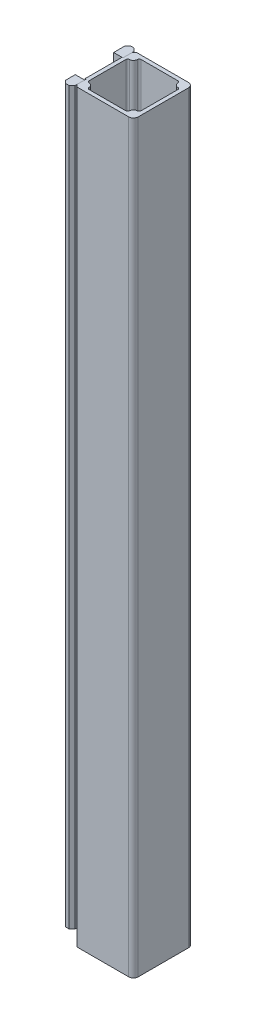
ISO-10303-21;
HEADER;
FILE_DESCRIPTION(('STEP AP214'),'2;1');
FILE_NAME('part.step','',(''),(''),'','','');
FILE_SCHEMA(('AUTOMOTIVE_DESIGN { 1 0 10303 214 1 1 1 1 }'));
ENDSEC;
DATA;
#1=APPLICATION_CONTEXT('core data for automotive mechanical design processes');
#2=APPLICATION_PROTOCOL_DEFINITION('international standard','automotive_design',2000,#1);
#3=PRODUCT_CONTEXT('',#1,'mechanical');
#4=PRODUCT('Part','Part','',(#3));
#5=PRODUCT_RELATED_PRODUCT_CATEGORY('part','',(#4));
#6=PRODUCT_DEFINITION_FORMATION('','',#4);
#7=PRODUCT_DEFINITION_CONTEXT('part definition',#1,'design');
#8=PRODUCT_DEFINITION('design','',#6,#7);
#9=PRODUCT_DEFINITION_SHAPE('','',#8);
#10=(LENGTH_UNIT() NAMED_UNIT(*) SI_UNIT(.MILLI.,.METRE.));
#11=(NAMED_UNIT(*) PLANE_ANGLE_UNIT() SI_UNIT($,.RADIAN.));
#12=(NAMED_UNIT(*) SI_UNIT($,.STERADIAN.) SOLID_ANGLE_UNIT());
#13=UNCERTAINTY_MEASURE_WITH_UNIT(LENGTH_MEASURE(1.E-05),#10,'distance_accuracy_value','');
#14=(GEOMETRIC_REPRESENTATION_CONTEXT(3) GLOBAL_UNCERTAINTY_ASSIGNED_CONTEXT((#13)) GLOBAL_UNIT_ASSIGNED_CONTEXT((#10,
#11,#12)) REPRESENTATION_CONTEXT('',''));
#15=CARTESIAN_POINT('',(0.,0.,0.));
#16=DIRECTION('',(0.,0.,1.));
#17=DIRECTION('',(1.,0.,0.));
#18=AXIS2_PLACEMENT_3D('',#15,#16,#17);
#19=CARTESIAN_POINT('',(-25.5,1278.5,-90.5));
#20=DIRECTION('',(0.,1.,0.));
#21=DIRECTION('',(0.,0.,1.));
#22=AXIS2_PLACEMENT_3D('',#19,#20,#21);
#23=CYLINDRICAL_SURFACE('',#22,14.);
#24=CARTESIAN_POINT('',(-25.5,1278.5,-90.5));
#25=DIRECTION('',(0.,-1.,0.));
#26=DIRECTION('',(0.,0.,-1.));
#27=AXIS2_PLACEMENT_3D('',#24,#25,#26);
#28=CIRCLE('',#27,14.);
#29=CARTESIAN_POINT('',(-25.5,1278.5,-76.5));
#30=VERTEX_POINT('',#29);
#31=EDGE_CURVE('E11',#30,#30,#28,.T.);
#32=CARTESIAN_POINT('',(-25.5,1392.5,-90.5));
#33=DIRECTION('',(0.,-1.,0.));
#34=DIRECTION('',(0.,0.,-1.));
#35=AXIS2_PLACEMENT_3D('',#32,#33,#34);
#36=CIRCLE('',#35,14.);
#37=CARTESIAN_POINT('',(-25.5,1392.5,-76.5));
#38=VERTEX_POINT('',#37);
#39=EDGE_CURVE('E64',#38,#38,#36,.T.);
#40=CARTESIAN_POINT('',(-25.5,1278.5,-76.5));
#41=CARTESIAN_POINT('',(-25.5,1279.6875,-76.5));
#42=CARTESIAN_POINT('',(-25.5,1280.875,-76.5));
#43=CARTESIAN_POINT('',(-25.5,1283.25,-76.5));
#44=CARTESIAN_POINT('',(-25.5,1284.4375,-76.5));
#45=CARTESIAN_POINT('',(-25.5,1286.8125,-76.5));
#46=CARTESIAN_POINT('',(-25.5,1288.,-76.5));
#47=CARTESIAN_POINT('',(-25.5,1290.375,-76.5));
#48=CARTESIAN_POINT('',(-25.5,1291.5625,-76.5));
#49=CARTESIAN_POINT('',(-25.5,1293.9375,-76.5));
#50=CARTESIAN_POINT('',(-25.5,1295.125,-76.5));
#51=CARTESIAN_POINT('',(-25.5,1297.5,-76.5));
#52=CARTESIAN_POINT('',(-25.5,1298.6875,-76.5));
#53=CARTESIAN_POINT('',(-25.5,1301.0625,-76.5));
#54=CARTESIAN_POINT('',(-25.5,1302.25,-76.5));
#55=CARTESIAN_POINT('',(-25.5,1304.625,-76.5));
#56=CARTESIAN_POINT('',(-25.5,1305.8125,-76.5));
#57=CARTESIAN_POINT('',(-25.5,1308.1875,-76.5));
#58=CARTESIAN_POINT('',(-25.5,1309.375,-76.5));
#59=CARTESIAN_POINT('',(-25.5,1311.75,-76.5));
#60=CARTESIAN_POINT('',(-25.5,1312.9375,-76.5));
#61=CARTESIAN_POINT('',(-25.5,1315.3125,-76.5));
#62=CARTESIAN_POINT('',(-25.5,1316.5,-76.5));
#63=CARTESIAN_POINT('',(-25.5,1318.875,-76.5));
#64=CARTESIAN_POINT('',(-25.5,1320.0625,-76.5));
#65=CARTESIAN_POINT('',(-25.5,1322.4375,-76.5));
#66=CARTESIAN_POINT('',(-25.5,1323.625,-76.5));
#67=CARTESIAN_POINT('',(-25.5,1326.,-76.5));
#68=CARTESIAN_POINT('',(-25.5,1327.1875,-76.5));
#69=CARTESIAN_POINT('',(-25.5,1329.5625,-76.5));
#70=CARTESIAN_POINT('',(-25.5,1330.75,-76.5));
#71=CARTESIAN_POINT('',(-25.5,1333.125,-76.5));
#72=CARTESIAN_POINT('',(-25.5,1334.3125,-76.5));
#73=CARTESIAN_POINT('',(-25.5,1336.6875,-76.5));
#74=CARTESIAN_POINT('',(-25.5,1337.875,-76.5));
#75=CARTESIAN_POINT('',(-25.5,1340.25,-76.5));
#76=CARTESIAN_POINT('',(-25.5,1341.4375,-76.5));
#77=CARTESIAN_POINT('',(-25.5,1343.8125,-76.5));
#78=CARTESIAN_POINT('',(-25.5,1345.,-76.5));
#79=CARTESIAN_POINT('',(-25.5,1347.375,-76.5));
#80=CARTESIAN_POINT('',(-25.5,1348.5625,-76.5));
#81=CARTESIAN_POINT('',(-25.5,1350.9375,-76.5));
#82=CARTESIAN_POINT('',(-25.5,1352.125,-76.5));
#83=CARTESIAN_POINT('',(-25.5,1354.5,-76.5));
#84=CARTESIAN_POINT('',(-25.5,1355.6875,-76.5));
#85=CARTESIAN_POINT('',(-25.5,1358.0625,-76.5));
#86=CARTESIAN_POINT('',(-25.5,1359.25,-76.5));
#87=CARTESIAN_POINT('',(-25.5,1361.625,-76.5));
#88=CARTESIAN_POINT('',(-25.5,1362.8125,-76.5));
#89=CARTESIAN_POINT('',(-25.5,1365.1875,-76.5));
#90=CARTESIAN_POINT('',(-25.5,1366.375,-76.5));
#91=CARTESIAN_POINT('',(-25.5,1368.75,-76.5));
#92=CARTESIAN_POINT('',(-25.5,1369.9375,-76.5));
#93=CARTESIAN_POINT('',(-25.5,1372.3125,-76.5));
#94=CARTESIAN_POINT('',(-25.5,1373.5,-76.5));
#95=CARTESIAN_POINT('',(-25.5,1375.875,-76.5));
#96=CARTESIAN_POINT('',(-25.5,1377.0625,-76.5));
#97=CARTESIAN_POINT('',(-25.5,1379.4375,-76.5));
#98=CARTESIAN_POINT('',(-25.5,1380.625,-76.5));
#99=CARTESIAN_POINT('',(-25.5,1383.,-76.5));
#100=CARTESIAN_POINT('',(-25.5,1384.1875,-76.5));
#101=CARTESIAN_POINT('',(-25.5,1386.5625,-76.5));
#102=CARTESIAN_POINT('',(-25.5,1387.75,-76.5));
#103=CARTESIAN_POINT('',(-25.5,1390.125,-76.5));
#104=CARTESIAN_POINT('',(-25.5,1391.3125,-76.5));
#105=CARTESIAN_POINT('',(-25.5,1392.5,-76.5));
#106=B_SPLINE_CURVE_WITH_KNOTS('',3,(#40,#41,#42,#43,#44,#45,#46,#47,#48,#49,#50,#51,#52,#53,
#54,#55,#56,#57,#58,#59,#60,#61,#62,#63,#64,#65,#66,#67,#68,#69,#70,#71,#72,#73,#74,#75,#76,#77,
#78,#79,#80,#81,#82,#83,#84,#85,#86,#87,#88,#89,#90,#91,#92,#93,#94,#95,#96,#97,#98,#99,#100,
#101,#102,#103,#104,#105),.UNSPECIFIED.,.F.,.F.,(4,2,2,2,2,2,2,2,2,2,2,2,2,2,2,2,2,2,2,2,2,2,2,
2,2,2,2,2,2,2,2,2,4),(0.,3.56249999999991,7.12499999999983,10.6875,14.2499999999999,17.8125,
21.3749999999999,24.9374999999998,28.5,32.0624999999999,35.625,39.1874999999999,
42.7499999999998,46.3125,49.8749999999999,53.4375,56.9999999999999,60.5624999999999,64.125,
67.6874999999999,71.25,74.8124999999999,78.3749999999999,81.9375,85.4999999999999,89.0625,
92.625,96.1875000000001,99.75,103.3125,106.875,110.4375,114.),.UNSPECIFIED.);
#107=EDGE_CURVE('BSEAM61',#30,#38,#106,.T.);
#108=ORIENTED_EDGE('',*,*,#31,.F.);
#109=ORIENTED_EDGE('',*,*,#39,.T.);
#110=ORIENTED_EDGE('',*,*,#107,.T.);
#111=ORIENTED_EDGE('',*,*,#107,.F.);
#112=EDGE_LOOP('',(#108,#110,#109,#111));
#113=FACE_BOUND('',#112,.T.);
#114=ADVANCED_FACE('F61',(#113),#23,.T.);
#115=CARTESIAN_POINT('',(-25.5,1278.5,-90.5));
#116=DIRECTION('',(0.,-1.,0.));
#117=DIRECTION('',(0.,0.,-1.));
#118=AXIS2_PLACEMENT_3D('',#115,#116,#117);
#119=PLANE('',#118);
#120=ORIENTED_EDGE('',*,*,#31,.T.);
#121=EDGE_LOOP('',(#120));
#122=FACE_BOUND('',#121,.T.);
#123=ADVANCED_FACE('F76',(#122),#119,.T.);
#124=CARTESIAN_POINT('',(-25.5,1392.5,-90.5));
#125=DIRECTION('',(0.,-1.,0.));
#126=DIRECTION('',(0.,0.,-1.));
#127=AXIS2_PLACEMENT_3D('',#124,#125,#126);
#128=PLANE('',#127);
#129=ORIENTED_EDGE('',*,*,#39,.F.);
#130=EDGE_LOOP('',(#129));
#131=FACE_BOUND('',#130,.T.);
#132=ADVANCED_FACE('F74',(#131),#128,.F.);
#133=CLOSED_SHELL('',(#114,#123,#132));
#134=MANIFOLD_SOLID_BREP('B2',#133);
#135=CARTESIAN_POINT('',(-7.50000000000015,278.5,-110.5));
#136=DIRECTION('',(-1.,0.,0.));
#137=DIRECTION('',(0.,-1.,0.));
#138=AXIS2_PLACEMENT_3D('',#135,#136,#137);
#139=PLANE('',#138);
#140=DIRECTION('',(0.,-1.,0.));
#141=VECTOR('',#140,1.);
#142=CARTESIAN_POINT('',(-7.50000000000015,278.5,-62.5));
#143=LINE('',#142,#141);
#144=CARTESIAN_POINT('',(-7.50000000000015,278.5,-62.5));
#145=VERTEX_POINT('',#144);
#146=CARTESIAN_POINT('',(-7.50000000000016,198.5,-62.5));
#147=VERTEX_POINT('',#146);
#148=EDGE_CURVE('E192',#145,#147,#143,.T.);
#149=ORIENTED_EDGE('',*,*,#148,.T.);
#150=DIRECTION('',(0.,0.,1.));
#151=VECTOR('',#150,1.);
#152=CARTESIAN_POINT('',(-7.50000000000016,198.5,-110.5));
#153=LINE('',#152,#151);
#154=CARTESIAN_POINT('',(-7.50000000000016,198.5,-110.5));
#155=VERTEX_POINT('',#154);
#156=EDGE_CURVE('E59',#155,#147,#153,.T.);
#157=ORIENTED_EDGE('',*,*,#156,.F.);
#158=DIRECTION('',(0.,-1.,0.));
#159=VECTOR('',#158,1.);
#160=CARTESIAN_POINT('',(-7.50000000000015,278.5,-110.5));
#161=LINE('',#160,#159);
#162=CARTESIAN_POINT('',(-7.50000000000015,278.5,-110.5));
#163=VERTEX_POINT('',#162);
#164=EDGE_CURVE('E180',#163,#155,#161,.T.);
#165=ORIENTED_EDGE('',*,*,#164,.F.);
#166=DIRECTION('',(0.,0.,1.));
#167=VECTOR('',#166,1.);
#168=CARTESIAN_POINT('',(-7.50000000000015,278.5,-110.5));
#169=LINE('',#168,#167);
#170=EDGE_CURVE('E188',#163,#145,#169,.T.);
#171=ORIENTED_EDGE('',*,*,#170,.T.);
#172=EDGE_LOOP('',(#149,#157,#165,#171));
#173=FACE_BOUND('',#172,.T.);
#174=ADVANCED_FACE('F129',(#173),#139,.F.);
#175=CARTESIAN_POINT('',(-7.50000000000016,198.5,-110.5));
#176=DIRECTION('',(0.,1.,0.));
#177=DIRECTION('',(0.,0.,1.));
#178=AXIS2_PLACEMENT_3D('',#175,#176,#177);
#179=PLANE('',#178);
#180=DIRECTION('',(-1.,0.,0.));
#181=VECTOR('',#180,1.);
#182=CARTESIAN_POINT('',(-7.50000000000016,198.5,-62.5));
#183=LINE('',#182,#181);
#184=CARTESIAN_POINT('',(-43.5000000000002,198.5,-62.5));
#185=VERTEX_POINT('',#184);
#186=EDGE_CURVE('E184',#147,#185,#183,.T.);
#187=ORIENTED_EDGE('',*,*,#186,.T.);
#188=DIRECTION('',(0.,0.,1.));
#189=VECTOR('',#188,1.);
#190=CARTESIAN_POINT('',(-43.5000000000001,198.5,-110.5));
#191=LINE('',#190,#189);
#192=CARTESIAN_POINT('',(-43.5000000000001,198.5,-110.5));
#193=VERTEX_POINT('',#192);
#194=EDGE_CURVE('E137',#193,#185,#191,.T.);
#195=ORIENTED_EDGE('',*,*,#194,.F.);
#196=DIRECTION('',(-1.,0.,0.));
#197=VECTOR('',#196,1.);
#198=CARTESIAN_POINT('',(-7.50000000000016,198.5,-110.5));
#199=LINE('',#198,#197);
#200=EDGE_CURVE('E175',#155,#193,#199,.T.);
#201=ORIENTED_EDGE('',*,*,#200,.F.);
#202=ORIENTED_EDGE('',*,*,#156,.T.);
#203=EDGE_LOOP('',(#187,#195,#201,#202));
#204=FACE_BOUND('',#203,.T.);
#205=ADVANCED_FACE('F183',(#204),#179,.F.);
#206=CARTESIAN_POINT('',(-43.5000000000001,278.5,-110.5));
#207=DIRECTION('',(1.,0.,0.));
#208=DIRECTION('',(0.,0.,-1.));
#209=AXIS2_PLACEMENT_3D('',#206,#207,#208);
#210=PLANE('',#209);
#211=DIRECTION('',(0.,1.,0.));
#212=VECTOR('',#211,1.);
#213=CARTESIAN_POINT('',(-43.5000000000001,278.5,-62.5));
#214=LINE('',#213,#212);
#215=CARTESIAN_POINT('',(-43.5000000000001,278.5,-62.5));
#216=VERTEX_POINT('',#215);
#217=EDGE_CURVE('E162',#185,#216,#214,.T.);
#218=ORIENTED_EDGE('',*,*,#217,.T.);
#219=DIRECTION('',(0.,0.,1.));
#220=VECTOR('',#219,1.);
#221=CARTESIAN_POINT('',(-43.5000000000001,278.5,-110.5));
#222=LINE('',#221,#220);
#223=CARTESIAN_POINT('',(-43.5000000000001,278.5,-110.5));
#224=VERTEX_POINT('',#223);
#225=EDGE_CURVE('E185',#224,#216,#222,.T.);
#226=ORIENTED_EDGE('',*,*,#225,.F.);
#227=DIRECTION('',(0.,1.,0.));
#228=VECTOR('',#227,1.);
#229=CARTESIAN_POINT('',(-43.5000000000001,278.5,-110.5));
#230=LINE('',#229,#228);
#231=EDGE_CURVE('E178',#193,#224,#230,.T.);
#232=ORIENTED_EDGE('',*,*,#231,.F.);
#233=ORIENTED_EDGE('',*,*,#194,.T.);
#234=EDGE_LOOP('',(#218,#226,#232,#233));
#235=FACE_BOUND('',#234,.T.);
#236=ADVANCED_FACE('F186',(#235),#210,.F.);
#237=CARTESIAN_POINT('',(-7.50000000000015,278.5,-110.5));
#238=DIRECTION('',(0.,-1.,0.));
#239=DIRECTION('',(0.,0.,-1.));
#240=AXIS2_PLACEMENT_3D('',#237,#238,#239);
#241=PLANE('',#240);
#242=DIRECTION('',(1.,0.,0.));
#243=VECTOR('',#242,1.);
#244=CARTESIAN_POINT('',(-7.50000000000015,278.5,-62.5));
#245=LINE('',#244,#243);
#246=EDGE_CURVE('E168',#216,#145,#245,.T.);
#247=ORIENTED_EDGE('',*,*,#246,.T.);
#248=ORIENTED_EDGE('',*,*,#170,.F.);
#249=DIRECTION('',(1.,0.,0.));
#250=VECTOR('',#249,1.);
#251=CARTESIAN_POINT('',(-7.50000000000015,278.5,-110.5));
#252=LINE('',#251,#250);
#253=EDGE_CURVE('E145',#224,#163,#252,.T.);
#254=ORIENTED_EDGE('',*,*,#253,.F.);
#255=ORIENTED_EDGE('',*,*,#225,.T.);
#256=EDGE_LOOP('',(#247,#248,#254,#255));
#257=FACE_BOUND('',#256,.T.);
#258=ADVANCED_FACE('F199',(#257),#241,.F.);
#259=CARTESIAN_POINT('',(0.,0.,-110.5));
#260=DIRECTION('',(0.,0.,-1.));
#261=DIRECTION('',(-1.,0.,0.));
#262=AXIS2_PLACEMENT_3D('',#259,#260,#261);
#263=PLANE('',#262);
#264=ORIENTED_EDGE('',*,*,#164,.T.);
#265=ORIENTED_EDGE('',*,*,#200,.T.);
#266=ORIENTED_EDGE('',*,*,#231,.T.);
#267=ORIENTED_EDGE('',*,*,#253,.T.);
#268=EDGE_LOOP('',(#264,#265,#266,#267));
#269=FACE_BOUND('',#268,.T.);
#270=ADVANCED_FACE('F176',(#269),#263,.T.);
#271=CARTESIAN_POINT('',(0.,0.,-62.5));
#272=DIRECTION('',(0.,0.,-1.));
#273=DIRECTION('',(-1.,0.,0.));
#274=AXIS2_PLACEMENT_3D('',#271,#272,#273);
#275=PLANE('',#274);
#276=ORIENTED_EDGE('',*,*,#148,.F.);
#277=ORIENTED_EDGE('',*,*,#246,.F.);
#278=ORIENTED_EDGE('',*,*,#217,.F.);
#279=ORIENTED_EDGE('',*,*,#186,.F.);
#280=EDGE_LOOP('',(#276,#277,#278,#279));
#281=FACE_BOUND('',#280,.T.);
#282=ADVANCED_FACE('F202',(#281),#275,.F.);
#283=CLOSED_SHELL('',(#174,#205,#236,#258,#270,#282));
#284=MANIFOLD_SOLID_BREP('B6',#283);
#285=CARTESIAN_POINT('',(-7.5,1472.5,-110.5));
#286=DIRECTION('',(-1.,0.,0.));
#287=DIRECTION('',(0.,-1.,0.));
#288=AXIS2_PLACEMENT_3D('',#285,#286,#287);
#289=PLANE('',#288);
#290=DIRECTION('',(0.,-1.,0.));
#291=VECTOR('',#290,1.);
#292=CARTESIAN_POINT('',(-7.50000000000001,1472.5,-62.5));
#293=LINE('',#292,#291);
#294=CARTESIAN_POINT('',(-7.50000000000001,1472.5,-62.5));
#295=VERTEX_POINT('',#294);
#296=CARTESIAN_POINT('',(-7.50000000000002,1392.5,-62.5));
#297=VERTEX_POINT('',#296);
#298=EDGE_CURVE('E350',#295,#297,#293,.T.);
#299=ORIENTED_EDGE('',*,*,#298,.T.);
#300=DIRECTION('',(0.,0.,1.));
#301=VECTOR('',#300,1.);
#302=CARTESIAN_POINT('',(-7.50000000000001,1392.5,-110.5));
#303=LINE('',#302,#301);
#304=CARTESIAN_POINT('',(-7.50000000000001,1392.5,-110.5));
#305=VERTEX_POINT('',#304);
#306=EDGE_CURVE('E127',#305,#297,#303,.T.);
#307=ORIENTED_EDGE('',*,*,#306,.F.);
#308=DIRECTION('',(0.,-1.,0.));
#309=VECTOR('',#308,1.);
#310=CARTESIAN_POINT('',(-7.5,1472.5,-110.5));
#311=LINE('',#310,#309);
#312=CARTESIAN_POINT('',(-7.5,1472.5,-110.5));
#313=VERTEX_POINT('',#312);
#314=EDGE_CURVE('E338',#313,#305,#311,.T.);
#315=ORIENTED_EDGE('',*,*,#314,.F.);
#316=DIRECTION('',(0.,0.,1.));
#317=VECTOR('',#316,1.);
#318=CARTESIAN_POINT('',(-7.5,1472.5,-110.5));
#319=LINE('',#318,#317);
#320=EDGE_CURVE('E346',#313,#295,#319,.T.);
#321=ORIENTED_EDGE('',*,*,#320,.T.);
#322=EDGE_LOOP('',(#299,#307,#315,#321));
#323=FACE_BOUND('',#322,.T.);
#324=ADVANCED_FACE('F287',(#323),#289,.F.);
#325=CARTESIAN_POINT('',(-7.50000000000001,1392.5,-110.5));
#326=DIRECTION('',(0.,1.,0.));
#327=DIRECTION('',(0.,0.,1.));
#328=AXIS2_PLACEMENT_3D('',#325,#326,#327);
#329=PLANE('',#328);
#330=DIRECTION('',(-1.,0.,0.));
#331=VECTOR('',#330,1.);
#332=CARTESIAN_POINT('',(-7.50000000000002,1392.5,-62.5));
#333=LINE('',#332,#331);
#334=CARTESIAN_POINT('',(-43.5,1392.5,-62.5));
#335=VERTEX_POINT('',#334);
#336=EDGE_CURVE('E342',#297,#335,#333,.T.);
#337=ORIENTED_EDGE('',*,*,#336,.T.);
#338=DIRECTION('',(0.,0.,1.));
#339=VECTOR('',#338,1.);
#340=CARTESIAN_POINT('',(-43.5,1392.5,-110.5));
#341=LINE('',#340,#339);
#342=CARTESIAN_POINT('',(-43.5,1392.5,-110.5));
#343=VERTEX_POINT('',#342);
#344=EDGE_CURVE('E295',#343,#335,#341,.T.);
#345=ORIENTED_EDGE('',*,*,#344,.F.);
#346=DIRECTION('',(-1.,0.,0.));
#347=VECTOR('',#346,1.);
#348=CARTESIAN_POINT('',(-7.50000000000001,1392.5,-110.5));
#349=LINE('',#348,#347);
#350=EDGE_CURVE('E333',#305,#343,#349,.T.);
#351=ORIENTED_EDGE('',*,*,#350,.F.);
#352=ORIENTED_EDGE('',*,*,#306,.T.);
#353=EDGE_LOOP('',(#337,#345,#351,#352));
#354=FACE_BOUND('',#353,.T.);
#355=ADVANCED_FACE('F341',(#354),#329,.F.);
#356=CARTESIAN_POINT('',(-43.5,1472.5,-110.5));
#357=DIRECTION('',(1.,0.,0.));
#358=DIRECTION('',(0.,1.,0.));
#359=AXIS2_PLACEMENT_3D('',#356,#357,#358);
#360=PLANE('',#359);
#361=DIRECTION('',(0.,1.,0.));
#362=VECTOR('',#361,1.);
#363=CARTESIAN_POINT('',(-43.5,1472.5,-62.5));
#364=LINE('',#363,#362);
#365=CARTESIAN_POINT('',(-43.5,1472.5,-62.5));
#366=VERTEX_POINT('',#365);
#367=EDGE_CURVE('E320',#335,#366,#364,.T.);
#368=ORIENTED_EDGE('',*,*,#367,.T.);
#369=DIRECTION('',(0.,0.,1.));
#370=VECTOR('',#369,1.);
#371=CARTESIAN_POINT('',(-43.5,1472.5,-110.5));
#372=LINE('',#371,#370);
#373=CARTESIAN_POINT('',(-43.5,1472.5,-110.5));
#374=VERTEX_POINT('',#373);
#375=EDGE_CURVE('E343',#374,#366,#372,.T.);
#376=ORIENTED_EDGE('',*,*,#375,.F.);
#377=DIRECTION('',(0.,1.,0.));
#378=VECTOR('',#377,1.);
#379=CARTESIAN_POINT('',(-43.5,1472.5,-110.5));
#380=LINE('',#379,#378);
#381=EDGE_CURVE('E336',#343,#374,#380,.T.);
#382=ORIENTED_EDGE('',*,*,#381,.F.);
#383=ORIENTED_EDGE('',*,*,#344,.T.);
#384=EDGE_LOOP('',(#368,#376,#382,#383));
#385=FACE_BOUND('',#384,.T.);
#386=ADVANCED_FACE('F344',(#385),#360,.F.);
#387=CARTESIAN_POINT('',(-7.5,1472.5,-110.5));
#388=DIRECTION('',(0.,-1.,0.));
#389=DIRECTION('',(0.,0.,-1.));
#390=AXIS2_PLACEMENT_3D('',#387,#388,#389);
#391=PLANE('',#390);
#392=DIRECTION('',(1.,0.,0.));
#393=VECTOR('',#392,1.);
#394=CARTESIAN_POINT('',(-7.50000000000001,1472.5,-62.5));
#395=LINE('',#394,#393);
#396=EDGE_CURVE('E326',#366,#295,#395,.T.);
#397=ORIENTED_EDGE('',*,*,#396,.T.);
#398=ORIENTED_EDGE('',*,*,#320,.F.);
#399=DIRECTION('',(1.,0.,0.));
#400=VECTOR('',#399,1.);
#401=CARTESIAN_POINT('',(-7.5,1472.5,-110.5));
#402=LINE('',#401,#400);
#403=EDGE_CURVE('E303',#374,#313,#402,.T.);
#404=ORIENTED_EDGE('',*,*,#403,.F.);
#405=ORIENTED_EDGE('',*,*,#375,.T.);
#406=EDGE_LOOP('',(#397,#398,#404,#405));
#407=FACE_BOUND('',#406,.T.);
#408=ADVANCED_FACE('F357',(#407),#391,.F.);
#409=CARTESIAN_POINT('',(0.,0.,-110.5));
#410=DIRECTION('',(0.,0.,-1.));
#411=DIRECTION('',(-1.,0.,0.));
#412=AXIS2_PLACEMENT_3D('',#409,#410,#411);
#413=PLANE('',#412);
#414=ORIENTED_EDGE('',*,*,#314,.T.);
#415=ORIENTED_EDGE('',*,*,#350,.T.);
#416=ORIENTED_EDGE('',*,*,#381,.T.);
#417=ORIENTED_EDGE('',*,*,#403,.T.);
#418=EDGE_LOOP('',(#414,#415,#416,#417));
#419=FACE_BOUND('',#418,.T.);
#420=ADVANCED_FACE('F334',(#419),#413,.T.);
#421=CARTESIAN_POINT('',(0.,0.,-62.5));
#422=DIRECTION('',(0.,0.,-1.));
#423=DIRECTION('',(-1.,0.,0.));
#424=AXIS2_PLACEMENT_3D('',#421,#422,#423);
#425=PLANE('',#424);
#426=ORIENTED_EDGE('',*,*,#298,.F.);
#427=ORIENTED_EDGE('',*,*,#396,.F.);
#428=ORIENTED_EDGE('',*,*,#367,.F.);
#429=ORIENTED_EDGE('',*,*,#336,.F.);
#430=EDGE_LOOP('',(#426,#427,#428,#429));
#431=FACE_BOUND('',#430,.T.);
#432=ADVANCED_FACE('F360',(#431),#425,.F.);
#433=CLOSED_SHELL('',(#324,#355,#386,#408,#420,#432));
#434=MANIFOLD_SOLID_BREP('B53',#433);
#435=CARTESIAN_POINT('',(-60.5,1560.,-38.5));
#436=DIRECTION('',(1.,0.,0.));
#437=DIRECTION('',(0.,0.,-1.));
#438=AXIS2_PLACEMENT_3D('',#435,#436,#437);
#439=PLANE('',#438);
#440=DIRECTION('',(0.,0.,-1.));
#441=VECTOR('',#440,1.);
#442=CARTESIAN_POINT('',(-60.5000000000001,30.,0.));
#443=LINE('',#442,#441);
#444=CARTESIAN_POINT('',(-60.5,30.,-38.5));
#445=VERTEX_POINT('',#444);
#446=CARTESIAN_POINT('',(-60.5,30.,-58.));
#447=VERTEX_POINT('',#446);
#448=EDGE_CURVE('E844',#445,#447,#443,.T.);
#449=ORIENTED_EDGE('',*,*,#448,.T.);
#450=DIRECTION('',(0.,-1.,0.));
#451=VECTOR('',#450,1.);
#452=CARTESIAN_POINT('',(-60.5,1560.,-58.));
#453=LINE('',#452,#451);
#454=CARTESIAN_POINT('',(-60.5,0.,-58.));
#455=VERTEX_POINT('',#454);
#456=EDGE_CURVE('E1134',#447,#455,#453,.T.);
#457=ORIENTED_EDGE('',*,*,#456,.T.);
#458=DIRECTION('',(0.,0.,1.));
#459=VECTOR('',#458,1.);
#460=CARTESIAN_POINT('',(-60.5,0.,-38.5));
#461=LINE('',#460,#459);
#462=CARTESIAN_POINT('',(-60.5,0.,-38.5));
#463=VERTEX_POINT('',#462);
#464=EDGE_CURVE('E1107',#455,#463,#461,.T.);
#465=ORIENTED_EDGE('',*,*,#464,.T.);
#466=DIRECTION('',(0.,-1.,0.));
#467=VECTOR('',#466,1.);
#468=CARTESIAN_POINT('',(-60.5,1560.,-38.5));
#469=LINE('',#468,#467);
#470=EDGE_CURVE('E448',#445,#463,#469,.T.);
#471=ORIENTED_EDGE('',*,*,#470,.F.);
#472=EDGE_LOOP('',(#449,#457,#465,#471));
#473=FACE_BOUND('',#472,.T.);
#474=ADVANCED_FACE('F440',(#473),#439,.F.);
#475=CARTESIAN_POINT('',(-62.5,1560.,-38.5));
#476=DIRECTION('',(0.,0.,1.));
#477=DIRECTION('',(1.,0.,0.));
#478=AXIS2_PLACEMENT_3D('',#475,#476,#477);
#479=PLANE('',#478);
#480=DIRECTION('',(-1.,0.,0.));
#481=VECTOR('',#480,1.);
#482=CARTESIAN_POINT('',(0.,30.,-38.5));
#483=LINE('',#482,#481);
#484=CARTESIAN_POINT('',(-62.5,30.,-38.5));
#485=VERTEX_POINT('',#484);
#486=EDGE_CURVE('E458',#445,#485,#483,.T.);
#487=ORIENTED_EDGE('',*,*,#486,.F.);
#488=ORIENTED_EDGE('',*,*,#470,.T.);
#489=DIRECTION('',(-1.,0.,0.));
#490=VECTOR('',#489,1.);
#491=CARTESIAN_POINT('',(-62.5,0.,-38.5));
#492=LINE('',#491,#490);
#493=CARTESIAN_POINT('',(-62.5,0.,-38.5));
#494=VERTEX_POINT('',#493);
#495=EDGE_CURVE('E1138',#463,#494,#492,.T.);
#496=ORIENTED_EDGE('',*,*,#495,.T.);
#497=DIRECTION('',(0.,-1.,0.));
#498=VECTOR('',#497,1.);
#499=CARTESIAN_POINT('',(-62.5,1560.,-38.5));
#500=LINE('',#499,#498);
#501=EDGE_CURVE('E1212',#485,#494,#500,.T.);
#502=ORIENTED_EDGE('',*,*,#501,.F.);
#503=EDGE_LOOP('',(#487,#488,#496,#502));
#504=FACE_BOUND('',#503,.T.);
#505=ADVANCED_FACE('F1230',(#504),#479,.F.);
#506=CARTESIAN_POINT('',(-60.5,1560.,38.5));
#507=DIRECTION('',(1.,0.,0.));
#508=DIRECTION('',(0.,0.,-1.));
#509=AXIS2_PLACEMENT_3D('',#506,#507,#508);
#510=PLANE('',#509);
#511=DIRECTION('',(0.,0.,1.));
#512=VECTOR('',#511,1.);
#513=CARTESIAN_POINT('',(-60.5,30.,0.));
#514=LINE('',#513,#512);
#515=CARTESIAN_POINT('',(-60.5,30.,41.87));
#516=VERTEX_POINT('',#515);
#517=CARTESIAN_POINT('',(-60.5,30.,58.));
#518=VERTEX_POINT('',#517);
#519=EDGE_CURVE('E896',#516,#518,#514,.T.);
#520=ORIENTED_EDGE('',*,*,#519,.F.);
#521=DIRECTION('',(0.,1.,0.));
#522=VECTOR('',#521,1.);
#523=CARTESIAN_POINT('',(-60.5,30.,41.87));
#524=LINE('',#523,#522);
#525=CARTESIAN_POINT('',(-60.5,1559.99,41.87));
#526=VERTEX_POINT('',#525);
#527=EDGE_CURVE('E918',#516,#526,#524,.T.);
#528=ORIENTED_EDGE('',*,*,#527,.T.);
#529=DIRECTION('',(0.,0.,1.));
#530=VECTOR('',#529,1.);
#531=CARTESIAN_POINT('',(-60.5,1559.99,0.));
#532=LINE('',#531,#530);
#533=CARTESIAN_POINT('',(-60.5,1559.99,58.));
#534=VERTEX_POINT('',#533);
#535=EDGE_CURVE('E919',#526,#534,#532,.T.);
#536=ORIENTED_EDGE('',*,*,#535,.T.);
#537=DIRECTION('',(0.,-1.,0.));
#538=VECTOR('',#537,1.);
#539=CARTESIAN_POINT('',(-60.5,1560.,58.));
#540=LINE('',#539,#538);
#541=CARTESIAN_POINT('',(-60.5,1560.,58.));
#542=VERTEX_POINT('',#541);
#543=EDGE_CURVE('E1201',#542,#534,#540,.T.);
#544=ORIENTED_EDGE('',*,*,#543,.F.);
#545=DIRECTION('',(0.,0.,1.));
#546=VECTOR('',#545,1.);
#547=CARTESIAN_POINT('',(-60.5,1560.,38.5));
#548=LINE('',#547,#546);
#549=CARTESIAN_POINT('',(-60.5,1560.,38.5));
#550=VERTEX_POINT('',#549);
#551=EDGE_CURVE('E1118',#550,#542,#548,.T.);
#552=ORIENTED_EDGE('',*,*,#551,.F.);
#553=DIRECTION('',(0.,-1.,0.));
#554=VECTOR('',#553,1.);
#555=CARTESIAN_POINT('',(-60.5,1560.,38.5));
#556=LINE('',#555,#554);
#557=CARTESIAN_POINT('',(-60.5,0.,38.5));
#558=VERTEX_POINT('',#557);
#559=EDGE_CURVE('E1204',#550,#558,#556,.T.);
#560=ORIENTED_EDGE('',*,*,#559,.T.);
#561=DIRECTION('',(0.,0.,1.));
#562=VECTOR('',#561,1.);
#563=CARTESIAN_POINT('',(-60.5,0.,38.5));
#564=LINE('',#563,#562);
#565=CARTESIAN_POINT('',(-60.5,0.,58.));
#566=VERTEX_POINT('',#565);
#567=EDGE_CURVE('E1148',#558,#566,#564,.T.);
#568=ORIENTED_EDGE('',*,*,#567,.T.);
#569=EDGE_CURVE('E1200',#518,#566,#540,.T.);
#570=ORIENTED_EDGE('',*,*,#569,.F.);
#571=EDGE_LOOP('',(#520,#528,#536,#544,#552,#560,#568,#570));
#572=FACE_BOUND('',#571,.T.);
#573=ADVANCED_FACE('F1244',(#572),#510,.F.);
#574=CARTESIAN_POINT('',(-60.5,1560.,-58.));
#575=VERTEX_POINT('',#574);
#576=CARTESIAN_POINT('',(-60.5,1559.99,-58.));
#577=VERTEX_POINT('',#576);
#578=EDGE_CURVE('E1173',#575,#577,#453,.T.);
#579=ORIENTED_EDGE('',*,*,#578,.T.);
#580=DIRECTION('',(0.,0.,-1.));
#581=VECTOR('',#580,1.);
#582=CARTESIAN_POINT('',(-60.5000000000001,1559.99,0.));
#583=LINE('',#582,#581);
#584=CARTESIAN_POINT('',(-60.5,1559.99,-38.5));
#585=VERTEX_POINT('',#584);
#586=EDGE_CURVE('E466',#585,#577,#583,.T.);
#587=ORIENTED_EDGE('',*,*,#586,.F.);
#588=CARTESIAN_POINT('',(-60.5,1560.,-38.5));
#589=VERTEX_POINT('',#588);
#590=EDGE_CURVE('E285',#589,#585,#469,.T.);
#591=ORIENTED_EDGE('',*,*,#590,.F.);
#592=DIRECTION('',(0.,0.,1.));
#593=VECTOR('',#592,1.);
#594=CARTESIAN_POINT('',(-60.5,1560.,-38.5));
#595=LINE('',#594,#593);
#596=EDGE_CURVE('E1108',#575,#589,#595,.T.);
#597=ORIENTED_EDGE('',*,*,#596,.F.);
#598=EDGE_LOOP('',(#579,#587,#591,#597));
#599=FACE_BOUND('',#598,.T.);
#600=ADVANCED_FACE('F442',(#599),#439,.F.);
#601=ORIENTED_EDGE('',*,*,#590,.T.);
#602=DIRECTION('',(-1.,0.,0.));
#603=VECTOR('',#602,1.);
#604=CARTESIAN_POINT('',(0.,1559.99,-38.5));
#605=LINE('',#604,#603);
#606=CARTESIAN_POINT('',(-62.5,1559.99,-38.5));
#607=VERTEX_POINT('',#606);
#608=EDGE_CURVE('E863',#585,#607,#605,.T.);
#609=ORIENTED_EDGE('',*,*,#608,.T.);
#610=CARTESIAN_POINT('',(-62.5,1560.,-38.5));
#611=VERTEX_POINT('',#610);
#612=EDGE_CURVE('E1213',#611,#607,#500,.T.);
#613=ORIENTED_EDGE('',*,*,#612,.F.);
#614=DIRECTION('',(-1.,0.,0.));
#615=VECTOR('',#614,1.);
#616=CARTESIAN_POINT('',(-62.5,1560.,-38.5));
#617=LINE('',#616,#615);
#618=EDGE_CURVE('E1111',#589,#611,#617,.T.);
#619=ORIENTED_EDGE('',*,*,#618,.F.);
#620=EDGE_LOOP('',(#601,#609,#613,#619));
#621=FACE_BOUND('',#620,.T.);
#622=ADVANCED_FACE('F1253',(#621),#479,.F.);
#623=CARTESIAN_POINT('',(-62.5,1560.,38.5));
#624=DIRECTION('',(1.,0.,0.));
#625=DIRECTION('',(0.,0.,-1.));
#626=AXIS2_PLACEMENT_3D('',#623,#624,#625);
#627=PLANE('',#626);
#628=DIRECTION('',(0.,0.,1.));
#629=VECTOR('',#628,1.);
#630=CARTESIAN_POINT('',(-62.5,0.,38.5));
#631=LINE('',#630,#629);
#632=CARTESIAN_POINT('',(-62.5,0.,38.5));
#633=VERTEX_POINT('',#632);
#634=EDGE_CURVE('E1142',#494,#633,#631,.T.);
#635=ORIENTED_EDGE('',*,*,#634,.T.);
#636=DIRECTION('',(0.,-1.,0.));
#637=VECTOR('',#636,1.);
#638=CARTESIAN_POINT('',(-62.5,1560.,38.5));
#639=LINE('',#638,#637);
#640=CARTESIAN_POINT('',(-62.5,1560.,38.5));
#641=VERTEX_POINT('',#640);
#642=EDGE_CURVE('E1209',#641,#633,#639,.T.);
#643=ORIENTED_EDGE('',*,*,#642,.F.);
#644=DIRECTION('',(0.,0.,1.));
#645=VECTOR('',#644,1.);
#646=CARTESIAN_POINT('',(-62.5,1560.,38.5));
#647=LINE('',#646,#645);
#648=EDGE_CURVE('E1114',#611,#641,#647,.T.);
#649=ORIENTED_EDGE('',*,*,#648,.F.);
#650=ORIENTED_EDGE('',*,*,#612,.T.);
#651=EDGE_CURVE('E1215',#607,#485,#500,.T.);
#652=ORIENTED_EDGE('',*,*,#651,.T.);
#653=ORIENTED_EDGE('',*,*,#501,.T.);
#654=EDGE_LOOP('',(#635,#643,#649,#650,#652,#653));
#655=FACE_BOUND('',#654,.T.);
#656=ADVANCED_FACE('F1225',(#655),#627,.F.);
#657=CARTESIAN_POINT('',(-62.5,1560.,38.5));
#658=DIRECTION('',(0.,0.,-1.));
#659=DIRECTION('',(-1.,0.,0.));
#660=AXIS2_PLACEMENT_3D('',#657,#658,#659);
#661=PLANE('',#660);
#662=DIRECTION('',(1.,0.,0.));
#663=VECTOR('',#662,1.);
#664=CARTESIAN_POINT('',(-62.5,0.,38.5));
#665=LINE('',#664,#663);
#666=EDGE_CURVE('E1145',#633,#558,#665,.T.);
#667=ORIENTED_EDGE('',*,*,#666,.T.);
#668=ORIENTED_EDGE('',*,*,#559,.F.);
#669=DIRECTION('',(1.,0.,0.));
#670=VECTOR('',#669,1.);
#671=CARTESIAN_POINT('',(-62.5,1560.,38.5));
#672=LINE('',#671,#670);
#673=EDGE_CURVE('E1116',#641,#550,#672,.T.);
#674=ORIENTED_EDGE('',*,*,#673,.F.);
#675=ORIENTED_EDGE('',*,*,#642,.T.);
#676=EDGE_LOOP('',(#667,#668,#674,#675));
#677=FACE_BOUND('',#676,.T.);
#678=ADVANCED_FACE('F1239',(#677),#661,.F.);
#679=CARTESIAN_POINT('',(-60.5,1560.,58.));
#680=DIRECTION('',(0.707106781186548,0.,-0.707106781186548));
#681=DIRECTION('',(-0.707106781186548,0.,-0.707106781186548));
#682=AXIS2_PLACEMENT_3D('',#679,#680,#681);
#683=PLANE('',#682);
#684=DIRECTION('',(0.707106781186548,0.,0.707106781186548));
#685=VECTOR('',#684,1.);
#686=CARTESIAN_POINT('',(-60.5,0.,58.));
#687=LINE('',#686,#685);
#688=CARTESIAN_POINT('',(-56.,0.,62.5));
#689=VERTEX_POINT('',#688);
#690=EDGE_CURVE('E1152',#566,#689,#687,.T.);
#691=ORIENTED_EDGE('',*,*,#690,.T.);
#692=DIRECTION('',(0.,-1.,0.));
#693=VECTOR('',#692,1.);
#694=CARTESIAN_POINT('',(-56.,1560.,62.5));
#695=LINE('',#694,#693);
#696=CARTESIAN_POINT('',(-56.,1560.,62.5));
#697=VERTEX_POINT('',#696);
#698=EDGE_CURVE('E1196',#697,#689,#695,.T.);
#699=ORIENTED_EDGE('',*,*,#698,.F.);
#700=DIRECTION('',(0.707106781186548,0.,0.707106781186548));
#701=VECTOR('',#700,1.);
#702=CARTESIAN_POINT('',(-60.5,1560.,58.));
#703=LINE('',#702,#701);
#704=EDGE_CURVE('E1120',#542,#697,#703,.T.);
#705=ORIENTED_EDGE('',*,*,#704,.F.);
#706=ORIENTED_EDGE('',*,*,#543,.T.);
#707=EDGE_CURVE('E1205',#534,#518,#540,.T.);
#708=ORIENTED_EDGE('',*,*,#707,.T.);
#709=ORIENTED_EDGE('',*,*,#569,.T.);
#710=EDGE_LOOP('',(#691,#699,#705,#706,#708,#709));
#711=FACE_BOUND('',#710,.T.);
#712=ADVANCED_FACE('F1284',(#711),#683,.F.);
#713=CARTESIAN_POINT('',(-56.,1560.,62.5));
#714=DIRECTION('',(0.,0.,-1.));
#715=DIRECTION('',(-1.,0.,0.));
#716=AXIS2_PLACEMENT_3D('',#713,#714,#715);
#717=PLANE('',#716);
#718=DIRECTION('',(1.,0.,0.));
#719=VECTOR('',#718,1.);
#720=CARTESIAN_POINT('',(-56.,0.,62.5));
#721=LINE('',#720,#719);
#722=CARTESIAN_POINT('',(52.4999999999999,0.,62.5));
#723=VERTEX_POINT('',#722);
#724=EDGE_CURVE('E1155',#689,#723,#721,.T.);
#725=ORIENTED_EDGE('',*,*,#724,.T.);
#726=DIRECTION('',(0.,-1.,0.));
#727=VECTOR('',#726,1.);
#728=CARTESIAN_POINT('',(52.4999999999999,1560.,62.5));
#729=LINE('',#728,#727);
#730=CARTESIAN_POINT('',(52.4999999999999,1560.,62.5));
#731=VERTEX_POINT('',#730);
#732=EDGE_CURVE('E1192',#731,#723,#729,.T.);
#733=ORIENTED_EDGE('',*,*,#732,.F.);
#734=DIRECTION('',(1.,0.,0.));
#735=VECTOR('',#734,1.);
#736=CARTESIAN_POINT('',(-56.,1560.,62.5));
#737=LINE('',#736,#735);
#738=EDGE_CURVE('E1122',#697,#731,#737,.T.);
#739=ORIENTED_EDGE('',*,*,#738,.F.);
#740=ORIENTED_EDGE('',*,*,#698,.T.);
#741=EDGE_LOOP('',(#725,#733,#739,#740));
#742=FACE_BOUND('',#741,.T.);
#743=ADVANCED_FACE('F1321',(#742),#717,.F.);
#744=CARTESIAN_POINT('',(52.5,1560.,52.5));
#745=DIRECTION('',(0.,-1.,0.));
#746=DIRECTION('',(0.,0.,-1.));
#747=AXIS2_PLACEMENT_3D('',#744,#745,#746);
#748=CYLINDRICAL_SURFACE('',#747,10.);
#749=CARTESIAN_POINT('',(52.5,0.,52.5));
#750=DIRECTION('',(0.,1.,0.));
#751=DIRECTION('',(0.,0.,1.));
#752=AXIS2_PLACEMENT_3D('',#749,#750,#751);
#753=CIRCLE('',#752,10.);
#754=CARTESIAN_POINT('',(62.5,0.,52.4999999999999));
#755=VERTEX_POINT('',#754);
#756=EDGE_CURVE('E1158',#723,#755,#753,.T.);
#757=ORIENTED_EDGE('',*,*,#756,.T.);
#758=DIRECTION('',(0.,-1.,0.));
#759=VECTOR('',#758,1.);
#760=CARTESIAN_POINT('',(62.5,1560.,52.4999999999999));
#761=LINE('',#760,#759);
#762=CARTESIAN_POINT('',(62.5,1560.,52.4999999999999));
#763=VERTEX_POINT('',#762);
#764=EDGE_CURVE('E1188',#763,#755,#761,.T.);
#765=ORIENTED_EDGE('',*,*,#764,.F.);
#766=CARTESIAN_POINT('',(52.5,1560.,52.5));
#767=DIRECTION('',(0.,1.,0.));
#768=DIRECTION('',(0.,0.,1.));
#769=AXIS2_PLACEMENT_3D('',#766,#767,#768);
#770=CIRCLE('',#769,10.);
#771=EDGE_CURVE('E1124',#731,#763,#770,.T.);
#772=ORIENTED_EDGE('',*,*,#771,.F.);
#773=ORIENTED_EDGE('',*,*,#732,.T.);
#774=EDGE_LOOP('',(#757,#765,#772,#773));
#775=FACE_BOUND('',#774,.T.);
#776=ADVANCED_FACE('F1327',(#775),#748,.T.);
#777=CARTESIAN_POINT('',(62.5,1560.,52.4999999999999));
#778=DIRECTION('',(-1.,0.,0.));
#779=DIRECTION('',(0.,0.,1.));
#780=AXIS2_PLACEMENT_3D('',#777,#778,#779);
#781=PLANE('',#780);
#782=DIRECTION('',(0.,0.,-1.));
#783=VECTOR('',#782,1.);
#784=CARTESIAN_POINT('',(62.5,0.,52.4999999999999));
#785=LINE('',#784,#783);
#786=CARTESIAN_POINT('',(62.5,0.,-52.4999999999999));
#787=VERTEX_POINT('',#786);
#788=EDGE_CURVE('E1161',#755,#787,#785,.T.);
#789=ORIENTED_EDGE('',*,*,#788,.T.);
#790=DIRECTION('',(0.,-1.,0.));
#791=VECTOR('',#790,1.);
#792=CARTESIAN_POINT('',(62.5,1560.,-52.4999999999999));
#793=LINE('',#792,#791);
#794=CARTESIAN_POINT('',(62.5,1560.,-52.4999999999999));
#795=VERTEX_POINT('',#794);
#796=EDGE_CURVE('E1184',#795,#787,#793,.T.);
#797=ORIENTED_EDGE('',*,*,#796,.F.);
#798=DIRECTION('',(0.,0.,-1.));
#799=VECTOR('',#798,1.);
#800=CARTESIAN_POINT('',(62.5,1560.,52.4999999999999));
#801=LINE('',#800,#799);
#802=EDGE_CURVE('E1126',#763,#795,#801,.T.);
#803=ORIENTED_EDGE('',*,*,#802,.F.);
#804=ORIENTED_EDGE('',*,*,#764,.T.);
#805=EDGE_LOOP('',(#789,#797,#803,#804));
#806=FACE_BOUND('',#805,.T.);
#807=ADVANCED_FACE('F1331',(#806),#781,.F.);
#808=CARTESIAN_POINT('',(52.5,1560.,-52.5));
#809=DIRECTION('',(0.,-1.,0.));
#810=DIRECTION('',(0.,0.,-1.));
#811=AXIS2_PLACEMENT_3D('',#808,#809,#810);
#812=CYLINDRICAL_SURFACE('',#811,10.);
#813=CARTESIAN_POINT('',(52.5,0.,-52.5));
#814=DIRECTION('',(0.,1.,0.));
#815=DIRECTION('',(0.,0.,1.));
#816=AXIS2_PLACEMENT_3D('',#813,#814,#815);
#817=CIRCLE('',#816,10.);
#818=CARTESIAN_POINT('',(52.4999999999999,0.,-62.5));
#819=VERTEX_POINT('',#818);
#820=EDGE_CURVE('E1164',#787,#819,#817,.T.);
#821=ORIENTED_EDGE('',*,*,#820,.T.);
#822=DIRECTION('',(0.,-1.,0.));
#823=VECTOR('',#822,1.);
#824=CARTESIAN_POINT('',(52.4999999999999,1560.,-62.5));
#825=LINE('',#824,#823);
#826=CARTESIAN_POINT('',(52.4999999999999,1560.,-62.5));
#827=VERTEX_POINT('',#826);
#828=EDGE_CURVE('E1180',#827,#819,#825,.T.);
#829=ORIENTED_EDGE('',*,*,#828,.F.);
#830=CARTESIAN_POINT('',(52.5,1560.,-52.5));
#831=DIRECTION('',(0.,1.,0.));
#832=DIRECTION('',(0.,0.,1.));
#833=AXIS2_PLACEMENT_3D('',#830,#831,#832);
#834=CIRCLE('',#833,10.);
#835=EDGE_CURVE('E1128',#795,#827,#834,.T.);
#836=ORIENTED_EDGE('',*,*,#835,.F.);
#837=ORIENTED_EDGE('',*,*,#796,.T.);
#838=EDGE_LOOP('',(#821,#829,#836,#837));
#839=FACE_BOUND('',#838,.T.);
#840=ADVANCED_FACE('F1336',(#839),#812,.T.);
#841=CARTESIAN_POINT('',(-56.,1560.,-62.5));
#842=DIRECTION('',(0.,0.,1.));
#843=DIRECTION('',(1.,0.,0.));
#844=AXIS2_PLACEMENT_3D('',#841,#842,#843);
#845=PLANE('',#844);
#846=DIRECTION('',(-1.,0.,0.));
#847=VECTOR('',#846,1.);
#848=CARTESIAN_POINT('',(-56.,0.,-62.5));
#849=LINE('',#848,#847);
#850=CARTESIAN_POINT('',(-56.,0.,-62.5));
#851=VERTEX_POINT('',#850);
#852=EDGE_CURVE('E1167',#819,#851,#849,.T.);
#853=ORIENTED_EDGE('',*,*,#852,.T.);
#854=DIRECTION('',(0.,-1.,0.));
#855=VECTOR('',#854,1.);
#856=CARTESIAN_POINT('',(-56.,1560.,-62.5));
#857=LINE('',#856,#855);
#858=CARTESIAN_POINT('',(-56.,1560.,-62.5));
#859=VERTEX_POINT('',#858);
#860=EDGE_CURVE('E1175',#859,#851,#857,.T.);
#861=ORIENTED_EDGE('',*,*,#860,.F.);
#862=DIRECTION('',(-1.,0.,0.));
#863=VECTOR('',#862,1.);
#864=CARTESIAN_POINT('',(-56.,1560.,-62.5));
#865=LINE('',#864,#863);
#866=EDGE_CURVE('E1130',#827,#859,#865,.T.);
#867=ORIENTED_EDGE('',*,*,#866,.F.);
#868=ORIENTED_EDGE('',*,*,#828,.T.);
#869=EDGE_LOOP('',(#853,#861,#867,#868));
#870=FACE_BOUND('',#869,.T.);
#871=ADVANCED_FACE('F1341',(#870),#845,.F.);
#872=CARTESIAN_POINT('',(-60.5,1560.,-58.));
#873=DIRECTION('',(0.707106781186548,0.,0.707106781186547));
#874=DIRECTION('',(0.707106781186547,0.,-0.707106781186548));
#875=AXIS2_PLACEMENT_3D('',#872,#873,#874);
#876=PLANE('',#875);
#877=DIRECTION('',(-0.707106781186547,0.,0.707106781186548));
#878=VECTOR('',#877,1.);
#879=CARTESIAN_POINT('',(-60.5,0.,-58.));
#880=LINE('',#879,#878);
#881=EDGE_CURVE('E1112',#851,#455,#880,.T.);
#882=ORIENTED_EDGE('',*,*,#881,.T.);
#883=ORIENTED_EDGE('',*,*,#456,.F.);
#884=EDGE_CURVE('E1176',#577,#447,#453,.T.);
#885=ORIENTED_EDGE('',*,*,#884,.F.);
#886=ORIENTED_EDGE('',*,*,#578,.F.);
#887=DIRECTION('',(-0.707106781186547,0.,0.707106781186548));
#888=VECTOR('',#887,1.);
#889=CARTESIAN_POINT('',(-60.5,1560.,-58.));
#890=LINE('',#889,#888);
#891=EDGE_CURVE('E1132',#859,#575,#890,.T.);
#892=ORIENTED_EDGE('',*,*,#891,.F.);
#893=ORIENTED_EDGE('',*,*,#860,.T.);
#894=EDGE_LOOP('',(#882,#883,#885,#886,#892,#893));
#895=FACE_BOUND('',#894,.T.);
#896=ADVANCED_FACE('F1344',(#895),#876,.F.);
#897=CARTESIAN_POINT('',(52.5,1560.,-52.5));
#898=DIRECTION('',(0.,1.,0.));
#899=DIRECTION('',(0.,0.,1.));
#900=AXIS2_PLACEMENT_3D('',#897,#898,#899);
#901=PLANE('',#900);
#902=CARTESIAN_POINT('',(-50.4999999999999,1560.,-50.5));
#903=DIRECTION('',(0.,1.,0.));
#904=DIRECTION('',(0.,0.,1.));
#905=AXIS2_PLACEMENT_3D('',#902,#903,#904);
#906=CIRCLE('',#905,7.99999999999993);
#907=CARTESIAN_POINT('',(-50.5,1560.,-42.5));
#908=VERTEX_POINT('',#907);
#909=CARTESIAN_POINT('',(-42.5,1560.,-50.5));
#910=VERTEX_POINT('',#909);
#911=EDGE_CURVE('E957',#908,#910,#906,.T.);
#912=ORIENTED_EDGE('',*,*,#911,.T.);
#913=CARTESIAN_POINT('',(-38.5,1560.,-50.5));
#914=DIRECTION('',(0.,1.,0.));
#915=DIRECTION('',(0.,0.,1.));
#916=AXIS2_PLACEMENT_3D('',#913,#914,#915);
#917=CIRCLE('',#916,4.);
#918=CARTESIAN_POINT('',(-38.5,1560.,-54.5));
#919=VERTEX_POINT('',#918);
#920=EDGE_CURVE('E996',#919,#910,#917,.T.);
#921=ORIENTED_EDGE('',*,*,#920,.F.);
#922=DIRECTION('',(1.,0.,0.));
#923=VECTOR('',#922,1.);
#924=CARTESIAN_POINT('',(0.,1560.,-54.5));
#925=LINE('',#924,#923);
#926=CARTESIAN_POINT('',(38.5,1560.,-54.5));
#927=VERTEX_POINT('',#926);
#928=EDGE_CURVE('E993',#919,#927,#925,.T.);
#929=ORIENTED_EDGE('',*,*,#928,.T.);
#930=CARTESIAN_POINT('',(38.5,1560.,-50.5));
#931=DIRECTION('',(0.,1.,0.));
#932=DIRECTION('',(0.,0.,1.));
#933=AXIS2_PLACEMENT_3D('',#930,#931,#932);
#934=CIRCLE('',#933,4.);
#935=CARTESIAN_POINT('',(42.5,1560.,-50.5));
#936=VERTEX_POINT('',#935);
#937=EDGE_CURVE('E990',#927,#936,#934,.F.);
#938=ORIENTED_EDGE('',*,*,#937,.T.);
#939=CARTESIAN_POINT('',(50.5,1560.,-50.5));
#940=DIRECTION('',(0.,1.,0.));
#941=DIRECTION('',(0.,0.,1.));
#942=AXIS2_PLACEMENT_3D('',#939,#940,#941);
#943=CIRCLE('',#942,8.00000000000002);
#944=CARTESIAN_POINT('',(50.5,1560.,-42.5));
#945=VERTEX_POINT('',#944);
#946=EDGE_CURVE('E987',#936,#945,#943,.T.);
#947=ORIENTED_EDGE('',*,*,#946,.T.);
#948=CARTESIAN_POINT('',(50.5,1560.,-38.5));
#949=DIRECTION('',(0.,1.,0.));
#950=DIRECTION('',(0.,0.,1.));
#951=AXIS2_PLACEMENT_3D('',#948,#949,#950);
#952=CIRCLE('',#951,4.);
#953=CARTESIAN_POINT('',(54.5,1560.,-38.5));
#954=VERTEX_POINT('',#953);
#955=EDGE_CURVE('E985',#954,#945,#952,.T.);
#956=ORIENTED_EDGE('',*,*,#955,.F.);
#957=DIRECTION('',(0.,0.,1.));
#958=VECTOR('',#957,1.);
#959=CARTESIAN_POINT('',(54.5,1560.,0.));
#960=LINE('',#959,#958);
#961=CARTESIAN_POINT('',(54.5,1560.,38.5));
#962=VERTEX_POINT('',#961);
#963=EDGE_CURVE('E982',#954,#962,#960,.T.);
#964=ORIENTED_EDGE('',*,*,#963,.T.);
#965=CARTESIAN_POINT('',(50.5,1560.,38.5));
#966=DIRECTION('',(0.,1.,0.));
#967=DIRECTION('',(0.,0.,1.));
#968=AXIS2_PLACEMENT_3D('',#965,#966,#967);
#969=CIRCLE('',#968,4.00000000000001);
#970=CARTESIAN_POINT('',(50.5,1560.,42.5));
#971=VERTEX_POINT('',#970);
#972=EDGE_CURVE('E979',#962,#971,#969,.F.);
#973=ORIENTED_EDGE('',*,*,#972,.T.);
#974=CARTESIAN_POINT('',(50.5,1560.,50.5));
#975=DIRECTION('',(0.,1.,0.));
#976=DIRECTION('',(0.,0.,1.));
#977=AXIS2_PLACEMENT_3D('',#974,#975,#976);
#978=CIRCLE('',#977,8.);
#979=CARTESIAN_POINT('',(42.5,1560.,50.5));
#980=VERTEX_POINT('',#979);
#981=EDGE_CURVE('E977',#980,#971,#978,.F.);
#982=ORIENTED_EDGE('',*,*,#981,.F.);
#983=CARTESIAN_POINT('',(38.5,1560.,50.5));
#984=DIRECTION('',(0.,1.,0.));
#985=DIRECTION('',(0.,0.,1.));
#986=AXIS2_PLACEMENT_3D('',#983,#984,#985);
#987=CIRCLE('',#986,3.99999999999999);
#988=CARTESIAN_POINT('',(38.5,1560.,54.5));
#989=VERTEX_POINT('',#988);
#990=EDGE_CURVE('E975',#989,#980,#987,.T.);
#991=ORIENTED_EDGE('',*,*,#990,.F.);
#992=DIRECTION('',(1.,0.,0.));
#993=VECTOR('',#992,1.);
#994=CARTESIAN_POINT('',(0.,1560.,54.5));
#995=LINE('',#994,#993);
#996=CARTESIAN_POINT('',(-38.5,1560.,54.5));
#997=VERTEX_POINT('',#996);
#998=EDGE_CURVE('E973',#997,#989,#995,.T.);
#999=ORIENTED_EDGE('',*,*,#998,.F.);
#1000=CARTESIAN_POINT('',(-38.5,1560.,50.5));
#1001=DIRECTION('',(0.,1.,0.));
#1002=DIRECTION('',(0.,0.,1.));
#1003=AXIS2_PLACEMENT_3D('',#1000,#1001,#1002);
#1004=CIRCLE('',#1003,4.);
#1005=CARTESIAN_POINT('',(-42.5,1560.,50.5));
#1006=VERTEX_POINT('',#1005);
#1007=EDGE_CURVE('E970',#997,#1006,#1004,.F.);
#1008=ORIENTED_EDGE('',*,*,#1007,.T.);
#1009=CARTESIAN_POINT('',(-50.5,1560.,50.5));
#1010=DIRECTION('',(0.,1.,0.));
#1011=DIRECTION('',(0.,0.,1.));
#1012=AXIS2_PLACEMENT_3D('',#1009,#1010,#1011);
#1013=CIRCLE('',#1012,8.);
#1014=CARTESIAN_POINT('',(-50.5,1560.,42.5));
#1015=VERTEX_POINT('',#1014);
#1016=EDGE_CURVE('E968',#1015,#1006,#1013,.F.);
#1017=ORIENTED_EDGE('',*,*,#1016,.F.);
#1018=CARTESIAN_POINT('',(-50.5,1560.,38.5));
#1019=DIRECTION('',(0.,1.,0.));
#1020=DIRECTION('',(0.,0.,1.));
#1021=AXIS2_PLACEMENT_3D('',#1018,#1019,#1020);
#1022=CIRCLE('',#1021,4.);
#1023=CARTESIAN_POINT('',(-54.5,1560.,38.5));
#1024=VERTEX_POINT('',#1023);
#1025=EDGE_CURVE('E966',#1024,#1015,#1022,.T.);
#1026=ORIENTED_EDGE('',*,*,#1025,.F.);
#1027=DIRECTION('',(0.,0.,1.));
#1028=VECTOR('',#1027,1.);
#1029=CARTESIAN_POINT('',(-54.5,1560.,0.));
#1030=LINE('',#1029,#1028);
#1031=CARTESIAN_POINT('',(-54.5,1560.,-38.5));
#1032=VERTEX_POINT('',#1031);
#1033=EDGE_CURVE('E964',#1032,#1024,#1030,.T.);
#1034=ORIENTED_EDGE('',*,*,#1033,.F.);
#1035=CARTESIAN_POINT('',(-50.5,1560.,-38.5));
#1036=DIRECTION('',(0.,1.,0.));
#1037=DIRECTION('',(0.,0.,1.));
#1038=AXIS2_PLACEMENT_3D('',#1035,#1036,#1037);
#1039=CIRCLE('',#1038,4.);
#1040=EDGE_CURVE('E960',#1032,#908,#1039,.F.);
#1041=ORIENTED_EDGE('',*,*,#1040,.T.);
#1042=EDGE_LOOP('',(#912,#921,#929,#938,#947,#956,#964,#973,#982,#991,#999,#1008,#1017,#1026,
#1034,#1041));
#1043=FACE_BOUND('',#1042,.T.);
#1044=ORIENTED_EDGE('',*,*,#596,.T.);
#1045=ORIENTED_EDGE('',*,*,#618,.T.);
#1046=ORIENTED_EDGE('',*,*,#648,.T.);
#1047=ORIENTED_EDGE('',*,*,#673,.T.);
#1048=ORIENTED_EDGE('',*,*,#551,.T.);
#1049=ORIENTED_EDGE('',*,*,#704,.T.);
#1050=ORIENTED_EDGE('',*,*,#738,.T.);
#1051=ORIENTED_EDGE('',*,*,#771,.T.);
#1052=ORIENTED_EDGE('',*,*,#802,.T.);
#1053=ORIENTED_EDGE('',*,*,#835,.T.);
#1054=ORIENTED_EDGE('',*,*,#866,.T.);
#1055=ORIENTED_EDGE('',*,*,#891,.T.);
#1056=EDGE_LOOP('',(#1044,#1045,#1046,#1047,#1048,#1049,#1050,#1051,#1052,#1053,#1054,#1055));
#1057=FACE_BOUND('',#1056,.T.);
#1058=ADVANCED_FACE('F1249',(#1043,#1057),#901,.T.);
#1059=CARTESIAN_POINT('',(52.5,0.,-52.5));
#1060=DIRECTION('',(0.,1.,0.));
#1061=DIRECTION('',(0.,0.,1.));
#1062=AXIS2_PLACEMENT_3D('',#1059,#1060,#1061);
#1063=PLANE('',#1062);
#1064=CARTESIAN_POINT('',(-42.5,0.,58.5));
#1065=DIRECTION('',(0.,-1.,0.));
#1066=DIRECTION('',(0.,0.,-1.));
#1067=AXIS2_PLACEMENT_3D('',#1064,#1065,#1066);
#1068=CIRCLE('',#1067,2.49999999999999);
#1069=CARTESIAN_POINT('',(-42.5,0.,56.));
#1070=VERTEX_POINT('',#1069);
#1071=EDGE_CURVE('E793',#1070,#1070,#1068,.T.);
#1072=ORIENTED_EDGE('',*,*,#1071,.F.);
#1073=EDGE_LOOP('',(#1072));
#1074=FACE_BOUND('',#1073,.T.);
#1075=CARTESIAN_POINT('',(42.5,0.,-58.5));
#1076=DIRECTION('',(0.,-1.,0.));
#1077=DIRECTION('',(0.,0.,-1.));
#1078=AXIS2_PLACEMENT_3D('',#1075,#1076,#1077);
#1079=CIRCLE('',#1078,2.49999999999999);
#1080=CARTESIAN_POINT('',(42.5,0.,-61.));
#1081=VERTEX_POINT('',#1080);
#1082=EDGE_CURVE('E792',#1081,#1081,#1079,.T.);
#1083=ORIENTED_EDGE('',*,*,#1082,.F.);
#1084=EDGE_LOOP('',(#1083));
#1085=FACE_BOUND('',#1084,.T.);
#1086=CARTESIAN_POINT('',(52.5,0.,-52.5));
#1087=DIRECTION('',(0.,-1.,0.));
#1088=DIRECTION('',(0.,0.,-1.));
#1089=AXIS2_PLACEMENT_3D('',#1086,#1087,#1088);
#1090=CIRCLE('',#1089,3.39999999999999);
#1091=CARTESIAN_POINT('',(52.5,0.,-55.9));
#1092=VERTEX_POINT('',#1091);
#1093=EDGE_CURVE('E812',#1092,#1092,#1090,.T.);
#1094=ORIENTED_EDGE('',*,*,#1093,.F.);
#1095=EDGE_LOOP('',(#1094));
#1096=FACE_BOUND('',#1095,.T.);
#1097=CARTESIAN_POINT('',(52.5,0.,52.5));
#1098=DIRECTION('',(0.,-1.,0.));
#1099=DIRECTION('',(0.,0.,-1.));
#1100=AXIS2_PLACEMENT_3D('',#1097,#1098,#1099);
#1101=CIRCLE('',#1100,3.39999999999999);
#1102=CARTESIAN_POINT('',(52.5,0.,49.1));
#1103=VERTEX_POINT('',#1102);
#1104=EDGE_CURVE('E820',#1103,#1103,#1101,.T.);
#1105=ORIENTED_EDGE('',*,*,#1104,.F.);
#1106=EDGE_LOOP('',(#1105));
#1107=FACE_BOUND('',#1106,.T.);
#1108=CARTESIAN_POINT('',(-52.5,0.,52.5));
#1109=DIRECTION('',(0.,-1.,0.));
#1110=DIRECTION('',(0.,0.,-1.));
#1111=AXIS2_PLACEMENT_3D('',#1108,#1109,#1110);
#1112=CIRCLE('',#1111,3.39999999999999);
#1113=CARTESIAN_POINT('',(-52.5,0.,49.1));
#1114=VERTEX_POINT('',#1113);
#1115=EDGE_CURVE('E827',#1114,#1114,#1112,.T.);
#1116=ORIENTED_EDGE('',*,*,#1115,.F.);
#1117=EDGE_LOOP('',(#1116));
#1118=FACE_BOUND('',#1117,.T.);
#1119=CARTESIAN_POINT('',(-52.5,0.,-52.5));
#1120=DIRECTION('',(0.,-1.,0.));
#1121=DIRECTION('',(0.,0.,-1.));
#1122=AXIS2_PLACEMENT_3D('',#1119,#1120,#1121);
#1123=CIRCLE('',#1122,3.39999999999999);
#1124=CARTESIAN_POINT('',(-52.5,0.,-55.9));
#1125=VERTEX_POINT('',#1124);
#1126=EDGE_CURVE('E835',#1125,#1125,#1123,.T.);
#1127=ORIENTED_EDGE('',*,*,#1126,.F.);
#1128=EDGE_LOOP('',(#1127));
#1129=FACE_BOUND('',#1128,.T.);
#1130=CARTESIAN_POINT('',(-38.5,0.,-50.5));
#1131=DIRECTION('',(0.,1.,0.));
#1132=DIRECTION('',(0.,0.,1.));
#1133=AXIS2_PLACEMENT_3D('',#1130,#1131,#1132);
#1134=CIRCLE('',#1133,4.);
#1135=CARTESIAN_POINT('',(-38.5,0.,-54.5));
#1136=VERTEX_POINT('',#1135);
#1137=CARTESIAN_POINT('',(-42.5,0.,-50.5));
#1138=VERTEX_POINT('',#1137);
#1139=EDGE_CURVE('E961',#1136,#1138,#1134,.T.);
#1140=ORIENTED_EDGE('',*,*,#1139,.T.);
#1141=CARTESIAN_POINT('',(-50.4999999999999,0.,-50.5));
#1142=DIRECTION('',(0.,1.,0.));
#1143=DIRECTION('',(0.,0.,1.));
#1144=AXIS2_PLACEMENT_3D('',#1141,#1142,#1143);
#1145=CIRCLE('',#1144,7.99999999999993);
#1146=CARTESIAN_POINT('',(-50.5,0.,-42.5));
#1147=VERTEX_POINT('',#1146);
#1148=EDGE_CURVE('E940',#1147,#1138,#1145,.T.);
#1149=ORIENTED_EDGE('',*,*,#1148,.F.);
#1150=CARTESIAN_POINT('',(-50.5,0.,-38.5));
#1151=DIRECTION('',(0.,1.,0.));
#1152=DIRECTION('',(0.,0.,1.));
#1153=AXIS2_PLACEMENT_3D('',#1150,#1151,#1152);
#1154=CIRCLE('',#1153,4.);
#1155=CARTESIAN_POINT('',(-54.5,0.,-38.5));
#1156=VERTEX_POINT('',#1155);
#1157=EDGE_CURVE('E1001',#1156,#1147,#1154,.F.);
#1158=ORIENTED_EDGE('',*,*,#1157,.F.);
#1159=DIRECTION('',(0.,0.,1.));
#1160=VECTOR('',#1159,1.);
#1161=CARTESIAN_POINT('',(-54.5,0.,0.));
#1162=LINE('',#1161,#1160);
#1163=CARTESIAN_POINT('',(-54.5,0.,38.5));
#1164=VERTEX_POINT('',#1163);
#1165=EDGE_CURVE('E1005',#1156,#1164,#1162,.T.);
#1166=ORIENTED_EDGE('',*,*,#1165,.T.);
#1167=CARTESIAN_POINT('',(-50.5,0.,38.5));
#1168=DIRECTION('',(0.,1.,0.));
#1169=DIRECTION('',(0.,0.,1.));
#1170=AXIS2_PLACEMENT_3D('',#1167,#1168,#1169);
#1171=CIRCLE('',#1170,4.);
#1172=CARTESIAN_POINT('',(-50.5,0.,42.5));
#1173=VERTEX_POINT('',#1172);
#1174=EDGE_CURVE('E1009',#1164,#1173,#1171,.T.);
#1175=ORIENTED_EDGE('',*,*,#1174,.T.);
#1176=CARTESIAN_POINT('',(-50.5,0.,50.5));
#1177=DIRECTION('',(0.,1.,0.));
#1178=DIRECTION('',(0.,0.,1.));
#1179=AXIS2_PLACEMENT_3D('',#1176,#1177,#1178);
#1180=CIRCLE('',#1179,8.);
#1181=CARTESIAN_POINT('',(-42.5,0.,50.5));
#1182=VERTEX_POINT('',#1181);
#1183=EDGE_CURVE('E1013',#1173,#1182,#1180,.F.);
#1184=ORIENTED_EDGE('',*,*,#1183,.T.);
#1185=CARTESIAN_POINT('',(-38.5,0.,50.5));
#1186=DIRECTION('',(0.,1.,0.));
#1187=DIRECTION('',(0.,0.,1.));
#1188=AXIS2_PLACEMENT_3D('',#1185,#1186,#1187);
#1189=CIRCLE('',#1188,4.);
#1190=CARTESIAN_POINT('',(-38.5,0.,54.5));
#1191=VERTEX_POINT('',#1190);
#1192=EDGE_CURVE('E1017',#1191,#1182,#1189,.F.);
#1193=ORIENTED_EDGE('',*,*,#1192,.F.);
#1194=DIRECTION('',(1.,0.,0.));
#1195=VECTOR('',#1194,1.);
#1196=CARTESIAN_POINT('',(0.,0.,54.5));
#1197=LINE('',#1196,#1195);
#1198=CARTESIAN_POINT('',(38.5,0.,54.5));
#1199=VERTEX_POINT('',#1198);
#1200=EDGE_CURVE('E1020',#1191,#1199,#1197,.T.);
#1201=ORIENTED_EDGE('',*,*,#1200,.T.);
#1202=CARTESIAN_POINT('',(38.5,0.,50.5));
#1203=DIRECTION('',(0.,1.,0.));
#1204=DIRECTION('',(0.,0.,1.));
#1205=AXIS2_PLACEMENT_3D('',#1202,#1203,#1204);
#1206=CIRCLE('',#1205,3.99999999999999);
#1207=CARTESIAN_POINT('',(42.5,0.,50.5));
#1208=VERTEX_POINT('',#1207);
#1209=EDGE_CURVE('E1024',#1199,#1208,#1206,.T.);
#1210=ORIENTED_EDGE('',*,*,#1209,.T.);
#1211=CARTESIAN_POINT('',(50.5,0.,50.5));
#1212=DIRECTION('',(0.,1.,0.));
#1213=DIRECTION('',(0.,0.,1.));
#1214=AXIS2_PLACEMENT_3D('',#1211,#1212,#1213);
#1215=CIRCLE('',#1214,8.);
#1216=CARTESIAN_POINT('',(50.5,0.,42.5));
#1217=VERTEX_POINT('',#1216);
#1218=EDGE_CURVE('E1028',#1208,#1217,#1215,.F.);
#1219=ORIENTED_EDGE('',*,*,#1218,.T.);
#1220=CARTESIAN_POINT('',(50.5,0.,38.5));
#1221=DIRECTION('',(0.,1.,0.));
#1222=DIRECTION('',(0.,0.,1.));
#1223=AXIS2_PLACEMENT_3D('',#1220,#1221,#1222);
#1224=CIRCLE('',#1223,4.00000000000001);
#1225=CARTESIAN_POINT('',(54.5,0.,38.5));
#1226=VERTEX_POINT('',#1225);
#1227=EDGE_CURVE('E1032',#1226,#1217,#1224,.F.);
#1228=ORIENTED_EDGE('',*,*,#1227,.F.);
#1229=DIRECTION('',(0.,0.,1.));
#1230=VECTOR('',#1229,1.);
#1231=CARTESIAN_POINT('',(54.5,0.,0.));
#1232=LINE('',#1231,#1230);
#1233=CARTESIAN_POINT('',(54.5,0.,-38.5));
#1234=VERTEX_POINT('',#1233);
#1235=EDGE_CURVE('E1036',#1234,#1226,#1232,.T.);
#1236=ORIENTED_EDGE('',*,*,#1235,.F.);
#1237=CARTESIAN_POINT('',(50.5,0.,-38.5));
#1238=DIRECTION('',(0.,1.,0.));
#1239=DIRECTION('',(0.,0.,1.));
#1240=AXIS2_PLACEMENT_3D('',#1237,#1238,#1239);
#1241=CIRCLE('',#1240,4.);
#1242=CARTESIAN_POINT('',(50.5,0.,-42.5));
#1243=VERTEX_POINT('',#1242);
#1244=EDGE_CURVE('E1040',#1234,#1243,#1241,.T.);
#1245=ORIENTED_EDGE('',*,*,#1244,.T.);
#1246=CARTESIAN_POINT('',(50.5,0.,-50.5));
#1247=DIRECTION('',(0.,1.,0.));
#1248=DIRECTION('',(0.,0.,1.));
#1249=AXIS2_PLACEMENT_3D('',#1246,#1247,#1248);
#1250=CIRCLE('',#1249,8.00000000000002);
#1251=CARTESIAN_POINT('',(42.5,0.,-50.5));
#1252=VERTEX_POINT('',#1251);
#1253=EDGE_CURVE('E1044',#1252,#1243,#1250,.T.);
#1254=ORIENTED_EDGE('',*,*,#1253,.F.);
#1255=CARTESIAN_POINT('',(38.5,0.,-50.5));
#1256=DIRECTION('',(0.,1.,0.));
#1257=DIRECTION('',(0.,0.,1.));
#1258=AXIS2_PLACEMENT_3D('',#1255,#1256,#1257);
#1259=CIRCLE('',#1258,4.);
#1260=CARTESIAN_POINT('',(38.5,0.,-54.5));
#1261=VERTEX_POINT('',#1260);
#1262=EDGE_CURVE('E1048',#1261,#1252,#1259,.F.);
#1263=ORIENTED_EDGE('',*,*,#1262,.F.);
#1264=DIRECTION('',(1.,0.,0.));
#1265=VECTOR('',#1264,1.);
#1266=CARTESIAN_POINT('',(0.,0.,-54.5));
#1267=LINE('',#1266,#1265);
#1268=EDGE_CURVE('E1052',#1136,#1261,#1267,.T.);
#1269=ORIENTED_EDGE('',*,*,#1268,.F.);
#1270=EDGE_LOOP('',(#1140,#1149,#1158,#1166,#1175,#1184,#1193,#1201,#1210,#1219,#1228,#1236,
#1245,#1254,#1263,#1269));
#1271=FACE_BOUND('',#1270,.T.);
#1272=ORIENTED_EDGE('',*,*,#464,.F.);
#1273=ORIENTED_EDGE('',*,*,#881,.F.);
#1274=ORIENTED_EDGE('',*,*,#852,.F.);
#1275=ORIENTED_EDGE('',*,*,#820,.F.);
#1276=ORIENTED_EDGE('',*,*,#788,.F.);
#1277=ORIENTED_EDGE('',*,*,#756,.F.);
#1278=ORIENTED_EDGE('',*,*,#724,.F.);
#1279=ORIENTED_EDGE('',*,*,#690,.F.);
#1280=ORIENTED_EDGE('',*,*,#567,.F.);
#1281=ORIENTED_EDGE('',*,*,#666,.F.);
#1282=ORIENTED_EDGE('',*,*,#634,.F.);
#1283=ORIENTED_EDGE('',*,*,#495,.F.);
#1284=EDGE_LOOP('',(#1272,#1273,#1274,#1275,#1276,#1277,#1278,#1279,#1280,#1281,#1282,#1283));
#1285=FACE_BOUND('',#1284,.T.);
#1286=ADVANCED_FACE('F1234',(#1074,#1085,#1096,#1107,#1118,#1129,#1271,#1285),#1063,.F.);
#1287=CARTESIAN_POINT('',(-50.4999999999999,1560.,-50.5));
#1288=DIRECTION('',(0.,-1.,0.));
#1289=DIRECTION('',(0.,0.,-1.));
#1290=AXIS2_PLACEMENT_3D('',#1287,#1288,#1289);
#1291=CYLINDRICAL_SURFACE('',#1290,7.99999999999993);
#1292=ORIENTED_EDGE('',*,*,#1148,.T.);
#1293=DIRECTION('',(0.,-1.,0.));
#1294=VECTOR('',#1293,1.);
#1295=CARTESIAN_POINT('',(-42.5,1560.,-50.5));
#1296=LINE('',#1295,#1294);
#1297=EDGE_CURVE('E998',#910,#1138,#1296,.T.);
#1298=ORIENTED_EDGE('',*,*,#1297,.F.);
#1299=ORIENTED_EDGE('',*,*,#911,.F.);
#1300=DIRECTION('',(0.,-1.,0.));
#1301=VECTOR('',#1300,1.);
#1302=CARTESIAN_POINT('',(-50.5,1560.,-42.5));
#1303=LINE('',#1302,#1301);
#1304=EDGE_CURVE('E1104',#908,#1147,#1303,.T.);
#1305=ORIENTED_EDGE('',*,*,#1304,.T.);
#1306=EDGE_LOOP('',(#1292,#1298,#1299,#1305));
#1307=FACE_BOUND('',#1306,.T.);
#1308=ADVANCED_FACE('F1378',(#1307),#1291,.T.);
#1309=CARTESIAN_POINT('',(-50.5,1560.,-38.5));
#1310=DIRECTION('',(0.,-1.,0.));
#1311=DIRECTION('',(0.,0.,-1.));
#1312=AXIS2_PLACEMENT_3D('',#1309,#1310,#1311);
#1313=CYLINDRICAL_SURFACE('',#1312,4.);
#1314=ORIENTED_EDGE('',*,*,#1157,.T.);
#1315=ORIENTED_EDGE('',*,*,#1304,.F.);
#1316=ORIENTED_EDGE('',*,*,#1040,.F.);
#1317=DIRECTION('',(0.,-1.,0.));
#1318=VECTOR('',#1317,1.);
#1319=CARTESIAN_POINT('',(-54.5,1560.,-38.5));
#1320=LINE('',#1319,#1318);
#1321=EDGE_CURVE('E1101',#1032,#1156,#1320,.T.);
#1322=ORIENTED_EDGE('',*,*,#1321,.T.);
#1323=EDGE_LOOP('',(#1314,#1315,#1316,#1322));
#1324=FACE_BOUND('',#1323,.T.);
#1325=ADVANCED_FACE('F1385',(#1324),#1313,.F.);
#1326=CARTESIAN_POINT('',(-54.5,1560.,0.));
#1327=DIRECTION('',(1.,0.,0.));
#1328=DIRECTION('',(0.,0.,-1.));
#1329=AXIS2_PLACEMENT_3D('',#1326,#1327,#1328);
#1330=PLANE('',#1329);
#1331=ORIENTED_EDGE('',*,*,#1165,.F.);
#1332=ORIENTED_EDGE('',*,*,#1321,.F.);
#1333=ORIENTED_EDGE('',*,*,#1033,.T.);
#1334=DIRECTION('',(0.,-1.,0.));
#1335=VECTOR('',#1334,1.);
#1336=CARTESIAN_POINT('',(-54.5,1560.,38.5));
#1337=LINE('',#1336,#1335);
#1338=EDGE_CURVE('E1098',#1024,#1164,#1337,.T.);
#1339=ORIENTED_EDGE('',*,*,#1338,.T.);
#1340=EDGE_LOOP('',(#1331,#1332,#1333,#1339));
#1341=FACE_BOUND('',#1340,.T.);
#1342=ADVANCED_FACE('F1389',(#1341),#1330,.T.);
#1343=CARTESIAN_POINT('',(-50.5,1560.,38.5));
#1344=DIRECTION('',(0.,-1.,0.));
#1345=DIRECTION('',(0.,0.,-1.));
#1346=AXIS2_PLACEMENT_3D('',#1343,#1344,#1345);
#1347=CYLINDRICAL_SURFACE('',#1346,4.);
#1348=ORIENTED_EDGE('',*,*,#1174,.F.);
#1349=ORIENTED_EDGE('',*,*,#1338,.F.);
#1350=ORIENTED_EDGE('',*,*,#1025,.T.);
#1351=DIRECTION('',(0.,-1.,0.));
#1352=VECTOR('',#1351,1.);
#1353=CARTESIAN_POINT('',(-50.5,1560.,42.5));
#1354=LINE('',#1353,#1352);
#1355=EDGE_CURVE('E1095',#1015,#1173,#1354,.T.);
#1356=ORIENTED_EDGE('',*,*,#1355,.T.);
#1357=EDGE_LOOP('',(#1348,#1349,#1350,#1356));
#1358=FACE_BOUND('',#1357,.T.);
#1359=ADVANCED_FACE('F1393',(#1358),#1347,.F.);
#1360=CARTESIAN_POINT('',(-50.5,1560.,50.5));
#1361=DIRECTION('',(0.,-1.,0.));
#1362=DIRECTION('',(0.,0.,-1.));
#1363=AXIS2_PLACEMENT_3D('',#1360,#1361,#1362);
#1364=CYLINDRICAL_SURFACE('',#1363,8.);
#1365=ORIENTED_EDGE('',*,*,#1183,.F.);
#1366=ORIENTED_EDGE('',*,*,#1355,.F.);
#1367=ORIENTED_EDGE('',*,*,#1016,.T.);
#1368=DIRECTION('',(0.,-1.,0.));
#1369=VECTOR('',#1368,1.);
#1370=CARTESIAN_POINT('',(-42.5,1560.,50.5));
#1371=LINE('',#1370,#1369);
#1372=EDGE_CURVE('E1092',#1006,#1182,#1371,.T.);
#1373=ORIENTED_EDGE('',*,*,#1372,.T.);
#1374=EDGE_LOOP('',(#1365,#1366,#1367,#1373));
#1375=FACE_BOUND('',#1374,.T.);
#1376=ADVANCED_FACE('F1397',(#1375),#1364,.T.);
#1377=CARTESIAN_POINT('',(-38.5,1560.,50.5));
#1378=DIRECTION('',(0.,-1.,0.));
#1379=DIRECTION('',(0.,0.,-1.));
#1380=AXIS2_PLACEMENT_3D('',#1377,#1378,#1379);
#1381=CYLINDRICAL_SURFACE('',#1380,4.);
#1382=ORIENTED_EDGE('',*,*,#1192,.T.);
#1383=ORIENTED_EDGE('',*,*,#1372,.F.);
#1384=ORIENTED_EDGE('',*,*,#1007,.F.);
#1385=DIRECTION('',(0.,-1.,0.));
#1386=VECTOR('',#1385,1.);
#1387=CARTESIAN_POINT('',(-38.5,1560.,54.5));
#1388=LINE('',#1387,#1386);
#1389=EDGE_CURVE('E1089',#997,#1191,#1388,.T.);
#1390=ORIENTED_EDGE('',*,*,#1389,.T.);
#1391=EDGE_LOOP('',(#1382,#1383,#1384,#1390));
#1392=FACE_BOUND('',#1391,.T.);
#1393=ADVANCED_FACE('F1401',(#1392),#1381,.F.);
#1394=CARTESIAN_POINT('',(0.,1560.,54.5));
#1395=DIRECTION('',(0.,0.,-1.));
#1396=DIRECTION('',(-1.,0.,0.));
#1397=AXIS2_PLACEMENT_3D('',#1394,#1395,#1396);
#1398=PLANE('',#1397);
#1399=ORIENTED_EDGE('',*,*,#1200,.F.);
#1400=ORIENTED_EDGE('',*,*,#1389,.F.);
#1401=ORIENTED_EDGE('',*,*,#998,.T.);
#1402=DIRECTION('',(0.,-1.,0.));
#1403=VECTOR('',#1402,1.);
#1404=CARTESIAN_POINT('',(38.5,1560.,54.5));
#1405=LINE('',#1404,#1403);
#1406=EDGE_CURVE('E1086',#989,#1199,#1405,.T.);
#1407=ORIENTED_EDGE('',*,*,#1406,.T.);
#1408=EDGE_LOOP('',(#1399,#1400,#1401,#1407));
#1409=FACE_BOUND('',#1408,.T.);
#1410=ADVANCED_FACE('F1405',(#1409),#1398,.T.);
#1411=CARTESIAN_POINT('',(38.5,1560.,50.5));
#1412=DIRECTION('',(0.,-1.,0.));
#1413=DIRECTION('',(0.,0.,-1.));
#1414=AXIS2_PLACEMENT_3D('',#1411,#1412,#1413);
#1415=CYLINDRICAL_SURFACE('',#1414,3.99999999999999);
#1416=ORIENTED_EDGE('',*,*,#1209,.F.);
#1417=ORIENTED_EDGE('',*,*,#1406,.F.);
#1418=ORIENTED_EDGE('',*,*,#990,.T.);
#1419=DIRECTION('',(0.,-1.,0.));
#1420=VECTOR('',#1419,1.);
#1421=CARTESIAN_POINT('',(42.5,1560.,50.5));
#1422=LINE('',#1421,#1420);
#1423=EDGE_CURVE('E1083',#980,#1208,#1422,.T.);
#1424=ORIENTED_EDGE('',*,*,#1423,.T.);
#1425=EDGE_LOOP('',(#1416,#1417,#1418,#1424));
#1426=FACE_BOUND('',#1425,.T.);
#1427=ADVANCED_FACE('F1409',(#1426),#1415,.F.);
#1428=CARTESIAN_POINT('',(50.5,1560.,50.5));
#1429=DIRECTION('',(0.,-1.,0.));
#1430=DIRECTION('',(0.,0.,-1.));
#1431=AXIS2_PLACEMENT_3D('',#1428,#1429,#1430);
#1432=CYLINDRICAL_SURFACE('',#1431,8.);
#1433=ORIENTED_EDGE('',*,*,#1218,.F.);
#1434=ORIENTED_EDGE('',*,*,#1423,.F.);
#1435=ORIENTED_EDGE('',*,*,#981,.T.);
#1436=DIRECTION('',(0.,-1.,0.));
#1437=VECTOR('',#1436,1.);
#1438=CARTESIAN_POINT('',(50.5,1560.,42.5));
#1439=LINE('',#1438,#1437);
#1440=EDGE_CURVE('E1080',#971,#1217,#1439,.T.);
#1441=ORIENTED_EDGE('',*,*,#1440,.T.);
#1442=EDGE_LOOP('',(#1433,#1434,#1435,#1441));
#1443=FACE_BOUND('',#1442,.T.);
#1444=ADVANCED_FACE('F1413',(#1443),#1432,.T.);
#1445=CARTESIAN_POINT('',(50.5,1560.,38.5));
#1446=DIRECTION('',(0.,-1.,0.));
#1447=DIRECTION('',(0.,0.,-1.));
#1448=AXIS2_PLACEMENT_3D('',#1445,#1446,#1447);
#1449=CYLINDRICAL_SURFACE('',#1448,4.00000000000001);
#1450=ORIENTED_EDGE('',*,*,#1227,.T.);
#1451=ORIENTED_EDGE('',*,*,#1440,.F.);
#1452=ORIENTED_EDGE('',*,*,#972,.F.);
#1453=DIRECTION('',(0.,-1.,0.));
#1454=VECTOR('',#1453,1.);
#1455=CARTESIAN_POINT('',(54.5,1560.,38.5));
#1456=LINE('',#1455,#1454);
#1457=EDGE_CURVE('E1077',#962,#1226,#1456,.T.);
#1458=ORIENTED_EDGE('',*,*,#1457,.T.);
#1459=EDGE_LOOP('',(#1450,#1451,#1452,#1458));
#1460=FACE_BOUND('',#1459,.T.);
#1461=ADVANCED_FACE('F1417',(#1460),#1449,.F.);
#1462=CARTESIAN_POINT('',(54.5,1560.,0.));
#1463=DIRECTION('',(1.,0.,0.));
#1464=DIRECTION('',(0.,0.,-1.));
#1465=AXIS2_PLACEMENT_3D('',#1462,#1463,#1464);
#1466=PLANE('',#1465);
#1467=ORIENTED_EDGE('',*,*,#1235,.T.);
#1468=ORIENTED_EDGE('',*,*,#1457,.F.);
#1469=ORIENTED_EDGE('',*,*,#963,.F.);
#1470=DIRECTION('',(0.,-1.,0.));
#1471=VECTOR('',#1470,1.);
#1472=CARTESIAN_POINT('',(54.5,1560.,-38.5));
#1473=LINE('',#1472,#1471);
#1474=EDGE_CURVE('E1074',#954,#1234,#1473,.T.);
#1475=ORIENTED_EDGE('',*,*,#1474,.T.);
#1476=EDGE_LOOP('',(#1467,#1468,#1469,#1475));
#1477=FACE_BOUND('',#1476,.T.);
#1478=ADVANCED_FACE('F1421',(#1477),#1466,.F.);
#1479=CARTESIAN_POINT('',(50.5,1560.,-38.5));
#1480=DIRECTION('',(0.,-1.,0.));
#1481=DIRECTION('',(0.,0.,-1.));
#1482=AXIS2_PLACEMENT_3D('',#1479,#1480,#1481);
#1483=CYLINDRICAL_SURFACE('',#1482,4.);
#1484=ORIENTED_EDGE('',*,*,#1244,.F.);
#1485=ORIENTED_EDGE('',*,*,#1474,.F.);
#1486=ORIENTED_EDGE('',*,*,#955,.T.);
#1487=DIRECTION('',(0.,-1.,0.));
#1488=VECTOR('',#1487,1.);
#1489=CARTESIAN_POINT('',(50.5,1560.,-42.5));
#1490=LINE('',#1489,#1488);
#1491=EDGE_CURVE('E1071',#945,#1243,#1490,.T.);
#1492=ORIENTED_EDGE('',*,*,#1491,.T.);
#1493=EDGE_LOOP('',(#1484,#1485,#1486,#1492));
#1494=FACE_BOUND('',#1493,.T.);
#1495=ADVANCED_FACE('F1425',(#1494),#1483,.F.);
#1496=CARTESIAN_POINT('',(50.5,1560.,-50.5));
#1497=DIRECTION('',(0.,-1.,0.));
#1498=DIRECTION('',(0.,0.,-1.));
#1499=AXIS2_PLACEMENT_3D('',#1496,#1497,#1498);
#1500=CYLINDRICAL_SURFACE('',#1499,8.00000000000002);
#1501=ORIENTED_EDGE('',*,*,#1253,.T.);
#1502=ORIENTED_EDGE('',*,*,#1491,.F.);
#1503=ORIENTED_EDGE('',*,*,#946,.F.);
#1504=DIRECTION('',(0.,-1.,0.));
#1505=VECTOR('',#1504,1.);
#1506=CARTESIAN_POINT('',(42.5,1560.,-50.5));
#1507=LINE('',#1506,#1505);
#1508=EDGE_CURVE('E1068',#936,#1252,#1507,.T.);
#1509=ORIENTED_EDGE('',*,*,#1508,.T.);
#1510=EDGE_LOOP('',(#1501,#1502,#1503,#1509));
#1511=FACE_BOUND('',#1510,.T.);
#1512=ADVANCED_FACE('F1429',(#1511),#1500,.T.);
#1513=CARTESIAN_POINT('',(38.5,1560.,-50.5));
#1514=DIRECTION('',(0.,-1.,0.));
#1515=DIRECTION('',(0.,0.,-1.));
#1516=AXIS2_PLACEMENT_3D('',#1513,#1514,#1515);
#1517=CYLINDRICAL_SURFACE('',#1516,4.);
#1518=ORIENTED_EDGE('',*,*,#1262,.T.);
#1519=ORIENTED_EDGE('',*,*,#1508,.F.);
#1520=ORIENTED_EDGE('',*,*,#937,.F.);
#1521=DIRECTION('',(0.,-1.,0.));
#1522=VECTOR('',#1521,1.);
#1523=CARTESIAN_POINT('',(38.5,1560.,-54.5));
#1524=LINE('',#1523,#1522);
#1525=EDGE_CURVE('E1065',#927,#1261,#1524,.T.);
#1526=ORIENTED_EDGE('',*,*,#1525,.T.);
#1527=EDGE_LOOP('',(#1518,#1519,#1520,#1526));
#1528=FACE_BOUND('',#1527,.T.);
#1529=ADVANCED_FACE('F1433',(#1528),#1517,.F.);
#1530=CARTESIAN_POINT('',(0.,1560.,-54.5));
#1531=DIRECTION('',(0.,0.,-1.));
#1532=DIRECTION('',(-1.,0.,0.));
#1533=AXIS2_PLACEMENT_3D('',#1530,#1531,#1532);
#1534=PLANE('',#1533);
#1535=ORIENTED_EDGE('',*,*,#1268,.T.);
#1536=ORIENTED_EDGE('',*,*,#1525,.F.);
#1537=ORIENTED_EDGE('',*,*,#928,.F.);
#1538=DIRECTION('',(0.,-1.,0.));
#1539=VECTOR('',#1538,1.);
#1540=CARTESIAN_POINT('',(-38.5,1560.,-54.5));
#1541=LINE('',#1540,#1539);
#1542=EDGE_CURVE('E1062',#919,#1136,#1541,.T.);
#1543=ORIENTED_EDGE('',*,*,#1542,.T.);
#1544=EDGE_LOOP('',(#1535,#1536,#1537,#1543));
#1545=FACE_BOUND('',#1544,.T.);
#1546=ADVANCED_FACE('F1437',(#1545),#1534,.F.);
#1547=CARTESIAN_POINT('',(-38.5,1560.,-50.5));
#1548=DIRECTION('',(0.,-1.,0.));
#1549=DIRECTION('',(0.,0.,-1.));
#1550=AXIS2_PLACEMENT_3D('',#1547,#1548,#1549);
#1551=CYLINDRICAL_SURFACE('',#1550,4.);
#1552=ORIENTED_EDGE('',*,*,#1139,.F.);
#1553=ORIENTED_EDGE('',*,*,#1542,.F.);
#1554=ORIENTED_EDGE('',*,*,#920,.T.);
#1555=ORIENTED_EDGE('',*,*,#1297,.T.);
#1556=EDGE_LOOP('',(#1552,#1553,#1554,#1555));
#1557=FACE_BOUND('',#1556,.T.);
#1558=ADVANCED_FACE('F1441',(#1557),#1551,.F.);
#1559=CARTESIAN_POINT('',(-60.5,30.,0.));
#1560=DIRECTION('',(-1.,0.,0.));
#1561=DIRECTION('',(0.,0.,1.));
#1562=AXIS2_PLACEMENT_3D('',#1559,#1560,#1561);
#1563=PLANE('',#1562);
#1564=CARTESIAN_POINT('',(-60.5,30.,62.));
#1565=VERTEX_POINT('',#1564);
#1566=EDGE_CURVE('E900',#518,#1565,#514,.T.);
#1567=ORIENTED_EDGE('',*,*,#1566,.F.);
#1568=ORIENTED_EDGE('',*,*,#707,.F.);
#1569=CARTESIAN_POINT('',(-60.5,1559.99,62.));
#1570=VERTEX_POINT('',#1569);
#1571=EDGE_CURVE('E882',#534,#1570,#532,.T.);
#1572=ORIENTED_EDGE('',*,*,#1571,.T.);
#1573=DIRECTION('',(0.,1.,0.));
#1574=VECTOR('',#1573,1.);
#1575=CARTESIAN_POINT('',(-60.5,30.,62.));
#1576=LINE('',#1575,#1574);
#1577=EDGE_CURVE('E936',#1565,#1570,#1576,.T.);
#1578=ORIENTED_EDGE('',*,*,#1577,.F.);
#1579=EDGE_LOOP('',(#1567,#1568,#1572,#1578));
#1580=FACE_BOUND('',#1579,.T.);
#1581=ADVANCED_FACE('F1293',(#1580),#1563,.F.);
#1582=CARTESIAN_POINT('',(0.750000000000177,30.,0.750000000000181));
#1583=DIRECTION('',(-0.707106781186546,0.,-0.70710678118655));
#1584=DIRECTION('',(-0.70710678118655,0.,0.707106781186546));
#1585=AXIS2_PLACEMENT_3D('',#1582,#1583,#1584);
#1586=PLANE('',#1585);
#1587=DIRECTION('',(-0.70710678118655,0.,0.707106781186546));
#1588=VECTOR('',#1587,1.);
#1589=CARTESIAN_POINT('',(0.750000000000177,1559.99,0.750000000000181));
#1590=LINE('',#1589,#1588);
#1591=CARTESIAN_POINT('',(-66.5,1559.99,68.));
#1592=VERTEX_POINT('',#1591);
#1593=EDGE_CURVE('E934',#1570,#1592,#1590,.T.);
#1594=ORIENTED_EDGE('',*,*,#1593,.T.);
#1595=DIRECTION('',(0.,1.,0.));
#1596=VECTOR('',#1595,1.);
#1597=CARTESIAN_POINT('',(-66.5,30.,68.));
#1598=LINE('',#1597,#1596);
#1599=CARTESIAN_POINT('',(-66.5,30.,68.));
#1600=VERTEX_POINT('',#1599);
#1601=EDGE_CURVE('E941',#1600,#1592,#1598,.T.);
#1602=ORIENTED_EDGE('',*,*,#1601,.F.);
#1603=DIRECTION('',(-0.70710678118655,0.,0.707106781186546));
#1604=VECTOR('',#1603,1.);
#1605=CARTESIAN_POINT('',(0.750000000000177,30.,0.750000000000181));
#1606=LINE('',#1605,#1604);
#1607=EDGE_CURVE('E915',#1565,#1600,#1606,.T.);
#1608=ORIENTED_EDGE('',*,*,#1607,.F.);
#1609=ORIENTED_EDGE('',*,*,#1577,.T.);
#1610=EDGE_LOOP('',(#1594,#1602,#1608,#1609));
#1611=FACE_BOUND('',#1610,.T.);
#1612=ADVANCED_FACE('F1298',(#1611),#1586,.F.);
#1613=CARTESIAN_POINT('',(0.,30.,68.));
#1614=DIRECTION('',(0.,0.,-1.));
#1615=DIRECTION('',(-1.,0.,0.));
#1616=AXIS2_PLACEMENT_3D('',#1613,#1614,#1615);
#1617=PLANE('',#1616);
#1618=DIRECTION('',(-1.,0.,0.));
#1619=VECTOR('',#1618,1.);
#1620=CARTESIAN_POINT('',(0.,1559.99,68.));
#1621=LINE('',#1620,#1619);
#1622=CARTESIAN_POINT('',(-74.,1559.99,68.));
#1623=VERTEX_POINT('',#1622);
#1624=EDGE_CURVE('E931',#1592,#1623,#1621,.T.);
#1625=ORIENTED_EDGE('',*,*,#1624,.T.);
#1626=DIRECTION('',(0.,1.,0.));
#1627=VECTOR('',#1626,1.);
#1628=CARTESIAN_POINT('',(-74.,30.,68.));
#1629=LINE('',#1628,#1627);
#1630=CARTESIAN_POINT('',(-74.,30.,68.));
#1631=VERTEX_POINT('',#1630);
#1632=EDGE_CURVE('E945',#1631,#1623,#1629,.T.);
#1633=ORIENTED_EDGE('',*,*,#1632,.F.);
#1634=DIRECTION('',(-1.,0.,0.));
#1635=VECTOR('',#1634,1.);
#1636=CARTESIAN_POINT('',(0.,30.,68.));
#1637=LINE('',#1636,#1635);
#1638=EDGE_CURVE('E912',#1600,#1631,#1637,.T.);
#1639=ORIENTED_EDGE('',*,*,#1638,.F.);
#1640=ORIENTED_EDGE('',*,*,#1601,.T.);
#1641=EDGE_LOOP('',(#1625,#1633,#1639,#1640));
#1642=FACE_BOUND('',#1641,.T.);
#1643=ADVANCED_FACE('F1304',(#1642),#1617,.F.);
#1644=CARTESIAN_POINT('',(-70.9999999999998,30.,71.0000000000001));
#1645=DIRECTION('',(-0.707106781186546,0.,0.707106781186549));
#1646=DIRECTION('',(0.707106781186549,0.,0.707106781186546));
#1647=AXIS2_PLACEMENT_3D('',#1644,#1645,#1646);
#1648=PLANE('',#1647);
#1649=DIRECTION('',(0.707106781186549,0.,0.707106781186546));
#1650=VECTOR('',#1649,1.);
#1651=CARTESIAN_POINT('',(-70.9999999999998,1559.99,71.0000000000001));
#1652=LINE('',#1651,#1650);
#1653=CARTESIAN_POINT('',(-80.,1559.99,62.));
#1654=VERTEX_POINT('',#1653);
#1655=EDGE_CURVE('E928',#1654,#1623,#1652,.T.);
#1656=ORIENTED_EDGE('',*,*,#1655,.F.);
#1657=DIRECTION('',(0.,1.,0.));
#1658=VECTOR('',#1657,1.);
#1659=CARTESIAN_POINT('',(-80.,30.,62.));
#1660=LINE('',#1659,#1658);
#1661=CARTESIAN_POINT('',(-80.,30.,62.));
#1662=VERTEX_POINT('',#1661);
#1663=EDGE_CURVE('E948',#1662,#1654,#1660,.T.);
#1664=ORIENTED_EDGE('',*,*,#1663,.F.);
#1665=DIRECTION('',(0.707106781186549,0.,0.707106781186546));
#1666=VECTOR('',#1665,1.);
#1667=CARTESIAN_POINT('',(-70.9999999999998,30.,71.0000000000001));
#1668=LINE('',#1667,#1666);
#1669=EDGE_CURVE('E908',#1662,#1631,#1668,.T.);
#1670=ORIENTED_EDGE('',*,*,#1669,.T.);
#1671=ORIENTED_EDGE('',*,*,#1632,.T.);
#1672=EDGE_LOOP('',(#1656,#1664,#1670,#1671));
#1673=FACE_BOUND('',#1672,.T.);
#1674=ADVANCED_FACE('F1308',(#1673),#1648,.T.);
#1675=CARTESIAN_POINT('',(-80.,30.,0.));
#1676=DIRECTION('',(-1.,0.,0.));
#1677=DIRECTION('',(0.,0.,1.));
#1678=AXIS2_PLACEMENT_3D('',#1675,#1676,#1677);
#1679=PLANE('',#1678);
#1680=DIRECTION('',(0.,0.,1.));
#1681=VECTOR('',#1680,1.);
#1682=CARTESIAN_POINT('',(-80.,1559.99,0.));
#1683=LINE('',#1682,#1681);
#1684=CARTESIAN_POINT('',(-80.,1559.99,41.87));
#1685=VERTEX_POINT('',#1684);
#1686=EDGE_CURVE('E925',#1685,#1654,#1683,.T.);
#1687=ORIENTED_EDGE('',*,*,#1686,.F.);
#1688=DIRECTION('',(0.,1.,0.));
#1689=VECTOR('',#1688,1.);
#1690=CARTESIAN_POINT('',(-80.,30.,41.87));
#1691=LINE('',#1690,#1689);
#1692=CARTESIAN_POINT('',(-80.,30.,41.87));
#1693=VERTEX_POINT('',#1692);
#1694=EDGE_CURVE('E951',#1693,#1685,#1691,.T.);
#1695=ORIENTED_EDGE('',*,*,#1694,.F.);
#1696=DIRECTION('',(0.,0.,1.));
#1697=VECTOR('',#1696,1.);
#1698=CARTESIAN_POINT('',(-80.,30.,0.));
#1699=LINE('',#1698,#1697);
#1700=EDGE_CURVE('E904',#1693,#1662,#1699,.T.);
#1701=ORIENTED_EDGE('',*,*,#1700,.T.);
#1702=ORIENTED_EDGE('',*,*,#1663,.T.);
#1703=EDGE_LOOP('',(#1687,#1695,#1701,#1702));
#1704=FACE_BOUND('',#1703,.T.);
#1705=ADVANCED_FACE('F1311',(#1704),#1679,.T.);
#1706=CARTESIAN_POINT('',(0.,30.,41.87));
#1707=DIRECTION('',(0.,0.,-1.));
#1708=DIRECTION('',(-1.,0.,0.));
#1709=AXIS2_PLACEMENT_3D('',#1706,#1707,#1708);
#1710=PLANE('',#1709);
#1711=DIRECTION('',(-1.,0.,0.));
#1712=VECTOR('',#1711,1.);
#1713=CARTESIAN_POINT('',(0.,1559.99,41.87));
#1714=LINE('',#1713,#1712);
#1715=EDGE_CURVE('E922',#526,#1685,#1714,.T.);
#1716=ORIENTED_EDGE('',*,*,#1715,.F.);
#1717=ORIENTED_EDGE('',*,*,#527,.F.);
#1718=DIRECTION('',(-1.,0.,0.));
#1719=VECTOR('',#1718,1.);
#1720=CARTESIAN_POINT('',(0.,30.,41.87));
#1721=LINE('',#1720,#1719);
#1722=EDGE_CURVE('E899',#516,#1693,#1721,.T.);
#1723=ORIENTED_EDGE('',*,*,#1722,.T.);
#1724=ORIENTED_EDGE('',*,*,#1694,.T.);
#1725=EDGE_LOOP('',(#1716,#1717,#1723,#1724));
#1726=FACE_BOUND('',#1725,.T.);
#1727=ADVANCED_FACE('F1314',(#1726),#1710,.T.);
#1728=CARTESIAN_POINT('',(0.,30.,0.));
#1729=DIRECTION('',(0.,1.,0.));
#1730=DIRECTION('',(0.,0.,1.));
#1731=AXIS2_PLACEMENT_3D('',#1728,#1729,#1730);
#1732=PLANE('',#1731);
#1733=ORIENTED_EDGE('',*,*,#519,.T.);
#1734=ORIENTED_EDGE('',*,*,#1566,.T.);
#1735=ORIENTED_EDGE('',*,*,#1607,.T.);
#1736=ORIENTED_EDGE('',*,*,#1638,.T.);
#1737=ORIENTED_EDGE('',*,*,#1669,.F.);
#1738=ORIENTED_EDGE('',*,*,#1700,.F.);
#1739=ORIENTED_EDGE('',*,*,#1722,.F.);
#1740=EDGE_LOOP('',(#1733,#1734,#1735,#1736,#1737,#1738,#1739));
#1741=FACE_BOUND('',#1740,.T.);
#1742=ADVANCED_FACE('F1288',(#1741),#1732,.F.);
#1743=CARTESIAN_POINT('',(0.,1559.99,0.));
#1744=DIRECTION('',(0.,1.,0.));
#1745=DIRECTION('',(0.,0.,1.));
#1746=AXIS2_PLACEMENT_3D('',#1743,#1744,#1745);
#1747=PLANE('',#1746);
#1748=ORIENTED_EDGE('',*,*,#535,.F.);
#1749=ORIENTED_EDGE('',*,*,#1715,.T.);
#1750=ORIENTED_EDGE('',*,*,#1686,.T.);
#1751=ORIENTED_EDGE('',*,*,#1655,.T.);
#1752=ORIENTED_EDGE('',*,*,#1624,.F.);
#1753=ORIENTED_EDGE('',*,*,#1593,.F.);
#1754=ORIENTED_EDGE('',*,*,#1571,.F.);
#1755=EDGE_LOOP('',(#1748,#1749,#1750,#1751,#1752,#1753,#1754));
#1756=FACE_BOUND('',#1755,.T.);
#1757=ADVANCED_FACE('F1316',(#1756),#1747,.T.);
#1758=CARTESIAN_POINT('',(0.,30.,-38.5));
#1759=DIRECTION('',(0.,0.,-1.));
#1760=DIRECTION('',(-1.,0.,0.));
#1761=AXIS2_PLACEMENT_3D('',#1758,#1759,#1760);
#1762=PLANE('',#1761);
#1763=CARTESIAN_POINT('',(-80.,30.,-38.5));
#1764=VERTEX_POINT('',#1763);
#1765=EDGE_CURVE('E843',#485,#1764,#483,.T.);
#1766=ORIENTED_EDGE('',*,*,#1765,.F.);
#1767=ORIENTED_EDGE('',*,*,#651,.F.);
#1768=CARTESIAN_POINT('',(-80.,1559.99,-38.5));
#1769=VERTEX_POINT('',#1768);
#1770=EDGE_CURVE('E839',#607,#1769,#605,.T.);
#1771=ORIENTED_EDGE('',*,*,#1770,.T.);
#1772=DIRECTION('',(0.,1.,0.));
#1773=VECTOR('',#1772,1.);
#1774=CARTESIAN_POINT('',(-80.,30.,-38.5));
#1775=LINE('',#1774,#1773);
#1776=EDGE_CURVE('E878',#1764,#1769,#1775,.T.);
#1777=ORIENTED_EDGE('',*,*,#1776,.F.);
#1778=EDGE_LOOP('',(#1766,#1767,#1771,#1777));
#1779=FACE_BOUND('',#1778,.T.);
#1780=ADVANCED_FACE('F1262',(#1779),#1762,.F.);
#1781=CARTESIAN_POINT('',(-60.5000000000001,30.,0.));
#1782=DIRECTION('',(1.,0.,0.));
#1783=DIRECTION('',(0.,0.,-1.));
#1784=AXIS2_PLACEMENT_3D('',#1781,#1782,#1783);
#1785=PLANE('',#1784);
#1786=ORIENTED_EDGE('',*,*,#884,.T.);
#1787=CARTESIAN_POINT('',(-60.5,30.,-61.999999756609));
#1788=VERTEX_POINT('',#1787);
#1789=EDGE_CURVE('E842',#447,#1788,#443,.T.);
#1790=ORIENTED_EDGE('',*,*,#1789,.T.);
#1791=DIRECTION('',(0.,1.,0.));
#1792=VECTOR('',#1791,1.);
#1793=CARTESIAN_POINT('',(-60.5,30.,-61.999999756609));
#1794=LINE('',#1793,#1792);
#1795=CARTESIAN_POINT('',(-60.5,1559.99,-61.999999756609));
#1796=VERTEX_POINT('',#1795);
#1797=EDGE_CURVE('E862',#1788,#1796,#1794,.T.);
#1798=ORIENTED_EDGE('',*,*,#1797,.T.);
#1799=EDGE_CURVE('E865',#577,#1796,#583,.T.);
#1800=ORIENTED_EDGE('',*,*,#1799,.F.);
#1801=EDGE_LOOP('',(#1786,#1790,#1798,#1800));
#1802=FACE_BOUND('',#1801,.T.);
#1803=ADVANCED_FACE('F1273',(#1802),#1785,.T.);
#1804=CARTESIAN_POINT('',(-80.,30.,0.));
#1805=DIRECTION('',(1.,0.,0.));
#1806=DIRECTION('',(0.,0.,-1.));
#1807=AXIS2_PLACEMENT_3D('',#1804,#1805,#1806);
#1808=PLANE('',#1807);
#1809=DIRECTION('',(0.,0.,-1.));
#1810=VECTOR('',#1809,1.);
#1811=CARTESIAN_POINT('',(-80.,1559.99,0.));
#1812=LINE('',#1811,#1810);
#1813=CARTESIAN_POINT('',(-80.,1559.99,-62.000000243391));
#1814=VERTEX_POINT('',#1813);
#1815=EDGE_CURVE('E876',#1769,#1814,#1812,.T.);
#1816=ORIENTED_EDGE('',*,*,#1815,.T.);
#1817=DIRECTION('',(0.,1.,0.));
#1818=VECTOR('',#1817,1.);
#1819=CARTESIAN_POINT('',(-80.,30.,-62.000000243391));
#1820=LINE('',#1819,#1818);
#1821=CARTESIAN_POINT('',(-80.,30.,-62.000000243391));
#1822=VERTEX_POINT('',#1821);
#1823=EDGE_CURVE('E883',#1822,#1814,#1820,.T.);
#1824=ORIENTED_EDGE('',*,*,#1823,.F.);
#1825=DIRECTION('',(0.,0.,-1.));
#1826=VECTOR('',#1825,1.);
#1827=CARTESIAN_POINT('',(-80.,30.,0.));
#1828=LINE('',#1827,#1826);
#1829=EDGE_CURVE('E859',#1764,#1822,#1828,.T.);
#1830=ORIENTED_EDGE('',*,*,#1829,.F.);
#1831=ORIENTED_EDGE('',*,*,#1776,.T.);
#1832=EDGE_LOOP('',(#1816,#1824,#1830,#1831));
#1833=FACE_BOUND('',#1832,.T.);
#1834=ADVANCED_FACE('F1466',(#1833),#1808,.F.);
#1835=CARTESIAN_POINT('',(-70.9999968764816,30.,-71.0000026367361));
#1836=DIRECTION('',(0.707106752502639,0.,0.707106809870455));
#1837=DIRECTION('',(0.707106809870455,0.,-0.707106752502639));
#1838=AXIS2_PLACEMENT_3D('',#1835,#1836,#1837);
#1839=PLANE('',#1838);
#1840=DIRECTION('',(0.707106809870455,0.,-0.707106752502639));
#1841=VECTOR('',#1840,1.);
#1842=CARTESIAN_POINT('',(-70.9999968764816,1559.99,-71.0000026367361));
#1843=LINE('',#1842,#1841);
#1844=CARTESIAN_POINT('',(-73.999999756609,1559.99,-68.));
#1845=VERTEX_POINT('',#1844);
#1846=EDGE_CURVE('E873',#1814,#1845,#1843,.T.);
#1847=ORIENTED_EDGE('',*,*,#1846,.T.);
#1848=DIRECTION('',(0.,1.,0.));
#1849=VECTOR('',#1848,1.);
#1850=CARTESIAN_POINT('',(-73.999999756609,30.,-68.));
#1851=LINE('',#1850,#1849);
#1852=CARTESIAN_POINT('',(-73.999999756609,30.,-68.));
#1853=VERTEX_POINT('',#1852);
#1854=EDGE_CURVE('E887',#1853,#1845,#1851,.T.);
#1855=ORIENTED_EDGE('',*,*,#1854,.F.);
#1856=DIRECTION('',(0.707106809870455,0.,-0.707106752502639));
#1857=VECTOR('',#1856,1.);
#1858=CARTESIAN_POINT('',(-70.9999968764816,30.,-71.0000026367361));
#1859=LINE('',#1858,#1857);
#1860=EDGE_CURVE('E856',#1822,#1853,#1859,.T.);
#1861=ORIENTED_EDGE('',*,*,#1860,.F.);
#1862=ORIENTED_EDGE('',*,*,#1823,.T.);
#1863=EDGE_LOOP('',(#1847,#1855,#1861,#1862));
#1864=FACE_BOUND('',#1863,.T.);
#1865=ADVANCED_FACE('F1474',(#1864),#1839,.F.);
#1866=CARTESIAN_POINT('',(0.,30.,-68.));
#1867=DIRECTION('',(0.,0.,-1.));
#1868=DIRECTION('',(-1.,0.,0.));
#1869=AXIS2_PLACEMENT_3D('',#1866,#1867,#1868);
#1870=PLANE('',#1869);
#1871=DIRECTION('',(-1.,0.,0.));
#1872=VECTOR('',#1871,1.);
#1873=CARTESIAN_POINT('',(0.,1559.99,-68.));
#1874=LINE('',#1873,#1872);
#1875=CARTESIAN_POINT('',(-66.499999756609,1559.99,-68.));
#1876=VERTEX_POINT('',#1875);
#1877=EDGE_CURVE('E870',#1876,#1845,#1874,.T.);
#1878=ORIENTED_EDGE('',*,*,#1877,.F.);
#1879=DIRECTION('',(0.,1.,0.));
#1880=VECTOR('',#1879,1.);
#1881=CARTESIAN_POINT('',(-66.499999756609,30.,-68.));
#1882=LINE('',#1881,#1880);
#1883=CARTESIAN_POINT('',(-66.499999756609,30.,-68.));
#1884=VERTEX_POINT('',#1883);
#1885=EDGE_CURVE('E890',#1884,#1876,#1882,.T.);
#1886=ORIENTED_EDGE('',*,*,#1885,.F.);
#1887=DIRECTION('',(-1.,0.,0.));
#1888=VECTOR('',#1887,1.);
#1889=CARTESIAN_POINT('',(0.,30.,-68.));
#1890=LINE('',#1889,#1888);
#1891=EDGE_CURVE('E852',#1884,#1853,#1890,.T.);
#1892=ORIENTED_EDGE('',*,*,#1891,.T.);
#1893=ORIENTED_EDGE('',*,*,#1854,.T.);
#1894=EDGE_LOOP('',(#1878,#1886,#1892,#1893));
#1895=FACE_BOUND('',#1894,.T.);
#1896=ADVANCED_FACE('F1470',(#1895),#1870,.T.);
#1897=CARTESIAN_POINT('',(0.74999742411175,30.,-0.749997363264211));
#1898=DIRECTION('',(0.707106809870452,0.,-0.707106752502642));
#1899=DIRECTION('',(-0.707106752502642,0.,-0.707106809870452));
#1900=AXIS2_PLACEMENT_3D('',#1897,#1898,#1899);
#1901=PLANE('',#1900);
#1902=DIRECTION('',(-0.707106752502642,0.,-0.707106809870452));
#1903=VECTOR('',#1902,1.);
#1904=CARTESIAN_POINT('',(0.74999742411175,1559.99,-0.749997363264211));
#1905=LINE('',#1904,#1903);
#1906=EDGE_CURVE('E867',#1796,#1876,#1905,.T.);
#1907=ORIENTED_EDGE('',*,*,#1906,.F.);
#1908=ORIENTED_EDGE('',*,*,#1797,.F.);
#1909=DIRECTION('',(-0.707106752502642,0.,-0.707106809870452));
#1910=VECTOR('',#1909,1.);
#1911=CARTESIAN_POINT('',(0.74999742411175,30.,-0.749997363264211));
#1912=LINE('',#1911,#1910);
#1913=EDGE_CURVE('E848',#1788,#1884,#1912,.T.);
#1914=ORIENTED_EDGE('',*,*,#1913,.T.);
#1915=ORIENTED_EDGE('',*,*,#1885,.T.);
#1916=EDGE_LOOP('',(#1907,#1908,#1914,#1915));
#1917=FACE_BOUND('',#1916,.T.);
#1918=ADVANCED_FACE('F1467',(#1917),#1901,.T.);
#1919=CARTESIAN_POINT('',(0.,30.,0.));
#1920=DIRECTION('',(0.,1.,0.));
#1921=DIRECTION('',(0.,0.,1.));
#1922=AXIS2_PLACEMENT_3D('',#1919,#1920,#1921);
#1923=PLANE('',#1922);
#1924=ORIENTED_EDGE('',*,*,#486,.T.);
#1925=ORIENTED_EDGE('',*,*,#1765,.T.);
#1926=ORIENTED_EDGE('',*,*,#1829,.T.);
#1927=ORIENTED_EDGE('',*,*,#1860,.T.);
#1928=ORIENTED_EDGE('',*,*,#1891,.F.);
#1929=ORIENTED_EDGE('',*,*,#1913,.F.);
#1930=ORIENTED_EDGE('',*,*,#1789,.F.);
#1931=ORIENTED_EDGE('',*,*,#448,.F.);
#1932=EDGE_LOOP('',(#1924,#1925,#1926,#1927,#1928,#1929,#1930,#1931));
#1933=FACE_BOUND('',#1932,.T.);
#1934=ADVANCED_FACE('F1266',(#1933),#1923,.F.);
#1935=CARTESIAN_POINT('',(0.,1559.99,0.));
#1936=DIRECTION('',(0.,1.,0.));
#1937=DIRECTION('',(0.,0.,1.));
#1938=AXIS2_PLACEMENT_3D('',#1935,#1936,#1937);
#1939=PLANE('',#1938);
#1940=ORIENTED_EDGE('',*,*,#608,.F.);
#1941=ORIENTED_EDGE('',*,*,#586,.T.);
#1942=ORIENTED_EDGE('',*,*,#1799,.T.);
#1943=ORIENTED_EDGE('',*,*,#1906,.T.);
#1944=ORIENTED_EDGE('',*,*,#1877,.T.);
#1945=ORIENTED_EDGE('',*,*,#1846,.F.);
#1946=ORIENTED_EDGE('',*,*,#1815,.F.);
#1947=ORIENTED_EDGE('',*,*,#1770,.F.);
#1948=EDGE_LOOP('',(#1940,#1941,#1942,#1943,#1944,#1945,#1946,#1947));
#1949=FACE_BOUND('',#1948,.T.);
#1950=ADVANCED_FACE('F1257',(#1949),#1939,.T.);
#1951=CARTESIAN_POINT('',(-52.5,0.,-52.5));
#1952=DIRECTION('',(0.,-1.,0.));
#1953=DIRECTION('',(0.,0.,-1.));
#1954=AXIS2_PLACEMENT_3D('',#1951,#1952,#1953);
#1955=CYLINDRICAL_SURFACE('',#1954,3.39999999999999);
#1956=CARTESIAN_POINT('',(-52.5,25.,-52.5));
#1957=DIRECTION('',(0.,-1.,0.));
#1958=DIRECTION('',(0.,0.,-1.));
#1959=AXIS2_PLACEMENT_3D('',#1956,#1957,#1958);
#1960=CIRCLE('',#1959,3.39999999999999);
#1961=CARTESIAN_POINT('',(-52.5,25.,-55.9));
#1962=VERTEX_POINT('',#1961);
#1963=EDGE_CURVE('E831',#1962,#1962,#1960,.T.);
#1964=ORIENTED_EDGE('',*,*,#1963,.F.);
#1965=EDGE_LOOP('',(#1964));
#1966=FACE_BOUND('',#1965,.T.);
#1967=ORIENTED_EDGE('',*,*,#1126,.T.);
#1968=EDGE_LOOP('',(#1967));
#1969=FACE_BOUND('',#1968,.T.);
#1970=ADVANCED_FACE('F1484',(#1966,#1969),#1955,.F.);
#1971=CARTESIAN_POINT('',(-52.5,25.,-52.5));
#1972=DIRECTION('',(0.,-1.,0.));
#1973=DIRECTION('',(0.,0.,-1.));
#1974=AXIS2_PLACEMENT_3D('',#1971,#1972,#1973);
#1975=CONICAL_SURFACE('',#1974,3.39999999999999,1.0471975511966);
#1976=CARTESIAN_POINT('',(-52.5,26.9629909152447,-52.5));
#1977=VERTEX_POINT('',#1976);
#1978=VERTEX_LOOP('',#1977);
#1979=FACE_BOUND('',#1978,.T.);
#1980=ORIENTED_EDGE('',*,*,#1963,.T.);
#1981=EDGE_LOOP('',(#1980));
#1982=FACE_BOUND('',#1981,.T.);
#1983=ADVANCED_FACE('F1489',(#1979,#1982),#1975,.F.);
#1984=CARTESIAN_POINT('',(-52.5,0.,52.5));
#1985=DIRECTION('',(0.,-1.,0.));
#1986=DIRECTION('',(0.,0.,-1.));
#1987=AXIS2_PLACEMENT_3D('',#1984,#1985,#1986);
#1988=CYLINDRICAL_SURFACE('',#1987,3.39999999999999);
#1989=CARTESIAN_POINT('',(-52.5,25.,52.5));
#1990=DIRECTION('',(0.,-1.,0.));
#1991=DIRECTION('',(0.,0.,-1.));
#1992=AXIS2_PLACEMENT_3D('',#1989,#1990,#1991);
#1993=CIRCLE('',#1992,3.39999999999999);
#1994=CARTESIAN_POINT('',(-52.5,25.,49.1));
#1995=VERTEX_POINT('',#1994);
#1996=EDGE_CURVE('E824',#1995,#1995,#1993,.T.);
#1997=ORIENTED_EDGE('',*,*,#1996,.F.);
#1998=EDGE_LOOP('',(#1997));
#1999=FACE_BOUND('',#1998,.T.);
#2000=ORIENTED_EDGE('',*,*,#1115,.T.);
#2001=EDGE_LOOP('',(#2000));
#2002=FACE_BOUND('',#2001,.T.);
#2003=ADVANCED_FACE('F1493',(#1999,#2002),#1988,.F.);
#2004=CARTESIAN_POINT('',(-52.5,25.,52.5));
#2005=DIRECTION('',(0.,-1.,0.));
#2006=DIRECTION('',(0.,0.,-1.));
#2007=AXIS2_PLACEMENT_3D('',#2004,#2005,#2006);
#2008=CONICAL_SURFACE('',#2007,3.39999999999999,1.0471975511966);
#2009=CARTESIAN_POINT('',(-52.5,26.9629909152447,52.5));
#2010=VERTEX_POINT('',#2009);
#2011=VERTEX_LOOP('',#2010);
#2012=FACE_BOUND('',#2011,.T.);
#2013=ORIENTED_EDGE('',*,*,#1996,.T.);
#2014=EDGE_LOOP('',(#2013));
#2015=FACE_BOUND('',#2014,.T.);
#2016=ADVANCED_FACE('F1497',(#2012,#2015),#2008,.F.);
#2017=CARTESIAN_POINT('',(52.5,0.,52.5));
#2018=DIRECTION('',(0.,-1.,0.));
#2019=DIRECTION('',(0.,0.,-1.));
#2020=AXIS2_PLACEMENT_3D('',#2017,#2018,#2019);
#2021=CYLINDRICAL_SURFACE('',#2020,3.39999999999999);
#2022=CARTESIAN_POINT('',(52.5,25.,52.5));
#2023=DIRECTION('',(0.,-1.,0.));
#2024=DIRECTION('',(0.,0.,-1.));
#2025=AXIS2_PLACEMENT_3D('',#2022,#2023,#2024);
#2026=CIRCLE('',#2025,3.39999999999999);
#2027=CARTESIAN_POINT('',(52.5,25.,49.1));
#2028=VERTEX_POINT('',#2027);
#2029=EDGE_CURVE('E816',#2028,#2028,#2026,.T.);
#2030=ORIENTED_EDGE('',*,*,#2029,.F.);
#2031=EDGE_LOOP('',(#2030));
#2032=FACE_BOUND('',#2031,.T.);
#2033=ORIENTED_EDGE('',*,*,#1104,.T.);
#2034=EDGE_LOOP('',(#2033));
#2035=FACE_BOUND('',#2034,.T.);
#2036=ADVANCED_FACE('F1501',(#2032,#2035),#2021,.F.);
#2037=CARTESIAN_POINT('',(52.5,25.,52.5));
#2038=DIRECTION('',(0.,-1.,0.));
#2039=DIRECTION('',(0.,0.,-1.));
#2040=AXIS2_PLACEMENT_3D('',#2037,#2038,#2039);
#2041=CONICAL_SURFACE('',#2040,3.39999999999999,1.0471975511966);
#2042=CARTESIAN_POINT('',(52.5,26.9629909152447,52.5));
#2043=VERTEX_POINT('',#2042);
#2044=VERTEX_LOOP('',#2043);
#2045=FACE_BOUND('',#2044,.T.);
#2046=ORIENTED_EDGE('',*,*,#2029,.T.);
#2047=EDGE_LOOP('',(#2046));
#2048=FACE_BOUND('',#2047,.T.);
#2049=ADVANCED_FACE('F1505',(#2045,#2048),#2041,.F.);
#2050=CARTESIAN_POINT('',(52.5,0.,-52.5));
#2051=DIRECTION('',(0.,-1.,0.));
#2052=DIRECTION('',(0.,0.,-1.));
#2053=AXIS2_PLACEMENT_3D('',#2050,#2051,#2052);
#2054=CYLINDRICAL_SURFACE('',#2053,3.39999999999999);
#2055=CARTESIAN_POINT('',(52.5,25.,-52.5));
#2056=DIRECTION('',(0.,-1.,0.));
#2057=DIRECTION('',(0.,0.,-1.));
#2058=AXIS2_PLACEMENT_3D('',#2055,#2056,#2057);
#2059=CIRCLE('',#2058,3.39999999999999);
#2060=CARTESIAN_POINT('',(52.5,25.,-55.9));
#2061=VERTEX_POINT('',#2060);
#2062=EDGE_CURVE('E808',#2061,#2061,#2059,.T.);
#2063=ORIENTED_EDGE('',*,*,#2062,.F.);
#2064=EDGE_LOOP('',(#2063));
#2065=FACE_BOUND('',#2064,.T.);
#2066=ORIENTED_EDGE('',*,*,#1093,.T.);
#2067=EDGE_LOOP('',(#2066));
#2068=FACE_BOUND('',#2067,.T.);
#2069=ADVANCED_FACE('F1509',(#2065,#2068),#2054,.F.);
#2070=CARTESIAN_POINT('',(52.5,25.,-52.5));
#2071=DIRECTION('',(0.,-1.,0.));
#2072=DIRECTION('',(0.,0.,-1.));
#2073=AXIS2_PLACEMENT_3D('',#2070,#2071,#2072);
#2074=CONICAL_SURFACE('',#2073,3.39999999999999,1.0471975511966);
#2075=CARTESIAN_POINT('',(52.5,26.9629909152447,-52.5));
#2076=VERTEX_POINT('',#2075);
#2077=VERTEX_LOOP('',#2076);
#2078=FACE_BOUND('',#2077,.T.);
#2079=ORIENTED_EDGE('',*,*,#2062,.T.);
#2080=EDGE_LOOP('',(#2079));
#2081=FACE_BOUND('',#2080,.T.);
#2082=ADVANCED_FACE('F1513',(#2078,#2081),#2074,.F.);
#2083=CARTESIAN_POINT('',(42.5,12.,-58.5));
#2084=DIRECTION('',(0.,-1.,0.));
#2085=DIRECTION('',(0.,0.,-1.));
#2086=AXIS2_PLACEMENT_3D('',#2083,#2084,#2085);
#2087=CONICAL_SURFACE('',#2086,2.49999999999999,1.02974425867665);
#2088=CARTESIAN_POINT('',(42.5,13.5021515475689,-58.5));
#2089=VERTEX_POINT('',#2088);
#2090=VERTEX_LOOP('',#2089);
#2091=FACE_BOUND('',#2090,.T.);
#2092=CARTESIAN_POINT('',(42.5,12.,-58.5));
#2093=DIRECTION('',(0.,-1.,0.));
#2094=DIRECTION('',(0.,0.,-1.));
#2095=AXIS2_PLACEMENT_3D('',#2092,#2093,#2094);
#2096=CIRCLE('',#2095,2.49999999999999);
#2097=CARTESIAN_POINT('',(42.5,12.,-61.));
#2098=VERTEX_POINT('',#2097);
#2099=EDGE_CURVE('E799',#2098,#2098,#2096,.T.);
#2100=ORIENTED_EDGE('',*,*,#2099,.T.);
#2101=EDGE_LOOP('',(#2100));
#2102=FACE_BOUND('',#2101,.T.);
#2103=ADVANCED_FACE('F1517',(#2091,#2102),#2087,.F.);
#2104=CARTESIAN_POINT('',(42.5,0.,-58.5));
#2105=DIRECTION('',(0.,-1.,0.));
#2106=DIRECTION('',(0.,0.,-1.));
#2107=AXIS2_PLACEMENT_3D('',#2104,#2105,#2106);
#2108=CYLINDRICAL_SURFACE('',#2107,2.49999999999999);
#2109=ORIENTED_EDGE('',*,*,#2099,.F.);
#2110=EDGE_LOOP('',(#2109));
#2111=FACE_BOUND('',#2110,.T.);
#2112=ORIENTED_EDGE('',*,*,#1082,.T.);
#2113=EDGE_LOOP('',(#2112));
#2114=FACE_BOUND('',#2113,.T.);
#2115=ADVANCED_FACE('F785',(#2111,#2114),#2108,.F.);
#2116=CARTESIAN_POINT('',(-42.5,12.,58.5));
#2117=DIRECTION('',(0.,-1.,0.));
#2118=DIRECTION('',(0.,0.,-1.));
#2119=AXIS2_PLACEMENT_3D('',#2116,#2117,#2118);
#2120=CONICAL_SURFACE('',#2119,2.49999999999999,1.02974425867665);
#2121=CARTESIAN_POINT('',(-42.5,13.5021515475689,58.5));
#2122=VERTEX_POINT('',#2121);
#2123=VERTEX_LOOP('',#2122);
#2124=FACE_BOUND('',#2123,.T.);
#2125=CARTESIAN_POINT('',(-42.5,12.,58.5));
#2126=DIRECTION('',(0.,-1.,0.));
#2127=DIRECTION('',(0.,0.,-1.));
#2128=AXIS2_PLACEMENT_3D('',#2125,#2126,#2127);
#2129=CIRCLE('',#2128,2.49999999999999);
#2130=CARTESIAN_POINT('',(-42.5,12.,56.));
#2131=VERTEX_POINT('',#2130);
#2132=EDGE_CURVE('E789',#2131,#2131,#2129,.T.);
#2133=ORIENTED_EDGE('',*,*,#2132,.T.);
#2134=EDGE_LOOP('',(#2133));
#2135=FACE_BOUND('',#2134,.T.);
#2136=ADVANCED_FACE('F781',(#2124,#2135),#2120,.F.);
#2137=CARTESIAN_POINT('',(-42.5,0.,58.5));
#2138=DIRECTION('',(0.,-1.,0.));
#2139=DIRECTION('',(0.,0.,-1.));
#2140=AXIS2_PLACEMENT_3D('',#2137,#2138,#2139);
#2141=CYLINDRICAL_SURFACE('',#2140,2.49999999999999);
#2142=ORIENTED_EDGE('',*,*,#2132,.F.);
#2143=EDGE_LOOP('',(#2142));
#2144=FACE_BOUND('',#2143,.T.);
#2145=ORIENTED_EDGE('',*,*,#1071,.T.);
#2146=EDGE_LOOP('',(#2145));
#2147=FACE_BOUND('',#2146,.T.);
#2148=ADVANCED_FACE('F784',(#2144,#2147),#2141,.F.);
#2149=CLOSED_SHELL('',(#474,#505,#573,#600,#622,#656,#678,#712,#743,#776,#807,#840,#871,#896,
#1058,#1286,#1308,#1325,#1342,#1359,#1376,#1393,#1410,#1427,#1444,#1461,#1478,#1495,#1512,#1529,
#1546,#1558,#1581,#1612,#1643,#1674,#1705,#1727,#1742,#1757,#1780,#1803,#1834,#1865,#1896,#1918,
#1934,#1950,#1970,#1983,#2003,#2016,#2036,#2049,#2069,#2082,#2103,#2115,#2136,#2148));
#2150=MANIFOLD_SOLID_BREP('B121',#2149);
#2151=ADVANCED_BREP_SHAPE_REPRESENTATION('',(#18,#134,#284,#434,#2150),#14);
#2152=SHAPE_DEFINITION_REPRESENTATION(#9,#2151);
ENDSEC;
END-ISO-10303-21;
